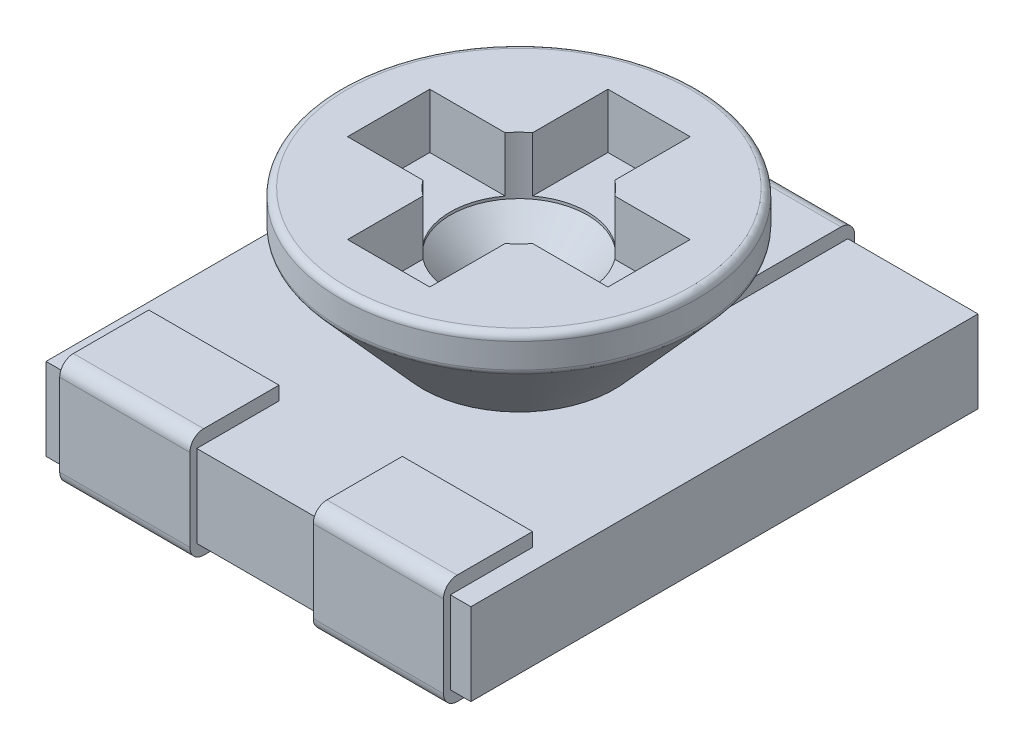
ISO-10303-21;
HEADER;
FILE_DESCRIPTION(('STEP AP214'),'2;1');
FILE_NAME('part.step','',(''),(''),'','','');
FILE_SCHEMA(('AUTOMOTIVE_DESIGN { 1 0 10303 214 1 1 1 1 }'));
ENDSEC;
DATA;
#1=APPLICATION_CONTEXT('core data for automotive mechanical design processes');
#2=APPLICATION_PROTOCOL_DEFINITION('international standard','automotive_design',2000,#1);
#3=PRODUCT_CONTEXT('',#1,'mechanical');
#4=PRODUCT('Part','Part','',(#3));
#5=PRODUCT_RELATED_PRODUCT_CATEGORY('part','',(#4));
#6=PRODUCT_DEFINITION_FORMATION('','',#4);
#7=PRODUCT_DEFINITION_CONTEXT('part definition',#1,'design');
#8=PRODUCT_DEFINITION('design','',#6,#7);
#9=PRODUCT_DEFINITION_SHAPE('','',#8);
#10=(LENGTH_UNIT() NAMED_UNIT(*) SI_UNIT(.MILLI.,.METRE.));
#11=(NAMED_UNIT(*) PLANE_ANGLE_UNIT() SI_UNIT($,.RADIAN.));
#12=(NAMED_UNIT(*) SI_UNIT($,.STERADIAN.) SOLID_ANGLE_UNIT());
#13=UNCERTAINTY_MEASURE_WITH_UNIT(LENGTH_MEASURE(1.E-05),#10,'distance_accuracy_value','');
#14=(GEOMETRIC_REPRESENTATION_CONTEXT(3) GLOBAL_UNCERTAINTY_ASSIGNED_CONTEXT((#13)) GLOBAL_UNIT_ASSIGNED_CONTEXT((#10,
#11,#12)) REPRESENTATION_CONTEXT('',''));
#15=CARTESIAN_POINT('',(0.,0.,0.));
#16=DIRECTION('',(0.,0.,1.));
#17=DIRECTION('',(1.,0.,0.));
#18=AXIS2_PLACEMENT_3D('',#15,#16,#17);
#19=CARTESIAN_POINT('',(-1.55,0.7,-1.8));
#20=DIRECTION('',(0.,-1.,0.));
#21=DIRECTION('',(0.,0.,-1.));
#22=AXIS2_PLACEMENT_3D('',#19,#20,#21);
#23=PLANE('',#22);
#24=CARTESIAN_POINT('',(0.,0.7,0.));
#25=DIRECTION('',(0.,-1.,0.));
#26=DIRECTION('',(0.,0.,-1.));
#27=AXIS2_PLACEMENT_3D('',#24,#25,#26);
#28=CIRCLE('',#27,0.7);
#29=CARTESIAN_POINT('',(0.,0.7,-0.7));
#30=VERTEX_POINT('',#29);
#31=EDGE_CURVE('E515',#30,#30,#28,.T.);
#32=ORIENTED_EDGE('',*,*,#31,.T.);
#33=EDGE_LOOP('',(#32));
#34=FACE_BOUND('',#33,.T.);
#35=DIRECTION('',(0.,0.,1.));
#36=VECTOR('',#35,1.);
#37=CARTESIAN_POINT('',(0.45,0.7,-1.8));
#38=LINE('',#37,#36);
#39=CARTESIAN_POINT('',(0.45,0.7,1.3));
#40=VERTEX_POINT('',#39);
#41=CARTESIAN_POINT('',(0.45,0.7,1.9));
#42=VERTEX_POINT('',#41);
#43=EDGE_CURVE('E573',#40,#42,#38,.T.);
#44=ORIENTED_EDGE('',*,*,#43,.F.);
#45=DIRECTION('',(-1.,0.,0.));
#46=VECTOR('',#45,1.);
#47=CARTESIAN_POINT('',(-1.55,0.7,1.3));
#48=LINE('',#47,#46);
#49=CARTESIAN_POINT('',(1.4,0.7,1.3));
#50=VERTEX_POINT('',#49);
#51=EDGE_CURVE('E577',#50,#40,#48,.T.);
#52=ORIENTED_EDGE('',*,*,#51,.F.);
#53=DIRECTION('',(0.,0.,-1.));
#54=VECTOR('',#53,1.);
#55=CARTESIAN_POINT('',(1.4,0.7,-1.8));
#56=LINE('',#55,#54);
#57=CARTESIAN_POINT('',(1.4,0.7,1.9));
#58=VERTEX_POINT('',#57);
#59=EDGE_CURVE('E566',#58,#50,#56,.T.);
#60=ORIENTED_EDGE('',*,*,#59,.F.);
#61=DIRECTION('',(1.,0.,0.));
#62=VECTOR('',#61,1.);
#63=CARTESIAN_POINT('',(-1.55,0.7,1.9));
#64=LINE('',#63,#62);
#65=CARTESIAN_POINT('',(1.55,0.7,1.9));
#66=VERTEX_POINT('',#65);
#67=EDGE_CURVE('E697',#58,#66,#64,.T.);
#68=ORIENTED_EDGE('',*,*,#67,.T.);
#69=DIRECTION('',(0.,0.,-1.));
#70=VECTOR('',#69,1.);
#71=CARTESIAN_POINT('',(1.55,0.7,1.9));
#72=LINE('',#71,#70);
#73=CARTESIAN_POINT('',(1.55,0.7,-1.8));
#74=VERTEX_POINT('',#73);
#75=EDGE_CURVE('E703',#66,#74,#72,.T.);
#76=ORIENTED_EDGE('',*,*,#75,.T.);
#77=DIRECTION('',(-1.,0.,0.));
#78=VECTOR('',#77,1.);
#79=CARTESIAN_POINT('',(-1.55,0.7,-1.8));
#80=LINE('',#79,#78);
#81=CARTESIAN_POINT('',(0.6,0.7,-1.8));
#82=VERTEX_POINT('',#81);
#83=EDGE_CURVE('E708',#74,#82,#80,.T.);
#84=ORIENTED_EDGE('',*,*,#83,.T.);
#85=DIRECTION('',(0.,0.,-1.));
#86=VECTOR('',#85,1.);
#87=CARTESIAN_POINT('',(0.6,0.7,-1.8));
#88=LINE('',#87,#86);
#89=CARTESIAN_POINT('',(0.6,0.7,-0.9));
#90=VERTEX_POINT('',#89);
#91=EDGE_CURVE('E680',#90,#82,#88,.T.);
#92=ORIENTED_EDGE('',*,*,#91,.F.);
#93=DIRECTION('',(1.,0.,0.));
#94=VECTOR('',#93,1.);
#95=CARTESIAN_POINT('',(-1.55,0.7,-0.9));
#96=LINE('',#95,#94);
#97=CARTESIAN_POINT('',(-0.6,0.7,-0.9));
#98=VERTEX_POINT('',#97);
#99=EDGE_CURVE('E683',#98,#90,#96,.T.);
#100=ORIENTED_EDGE('',*,*,#99,.F.);
#101=DIRECTION('',(0.,0.,1.));
#102=VECTOR('',#101,1.);
#103=CARTESIAN_POINT('',(-0.6,0.7,-1.8));
#104=LINE('',#103,#102);
#105=CARTESIAN_POINT('',(-0.6,0.7,-1.8));
#106=VERTEX_POINT('',#105);
#107=EDGE_CURVE('E689',#106,#98,#104,.T.);
#108=ORIENTED_EDGE('',*,*,#107,.F.);
#109=CARTESIAN_POINT('',(-1.55,0.7,-1.8));
#110=VERTEX_POINT('',#109);
#111=EDGE_CURVE('E707',#106,#110,#80,.T.);
#112=ORIENTED_EDGE('',*,*,#111,.T.);
#113=DIRECTION('',(0.,0.,1.));
#114=VECTOR('',#113,1.);
#115=CARTESIAN_POINT('',(-1.55,0.7,1.9));
#116=LINE('',#115,#114);
#117=CARTESIAN_POINT('',(-1.55,0.7,1.9));
#118=VERTEX_POINT('',#117);
#119=EDGE_CURVE('E693',#110,#118,#116,.T.);
#120=ORIENTED_EDGE('',*,*,#119,.T.);
#121=CARTESIAN_POINT('',(-1.4,0.7,1.9));
#122=VERTEX_POINT('',#121);
#123=EDGE_CURVE('E699',#118,#122,#64,.T.);
#124=ORIENTED_EDGE('',*,*,#123,.T.);
#125=DIRECTION('',(0.,0.,1.));
#126=VECTOR('',#125,1.);
#127=CARTESIAN_POINT('',(-1.4,0.7,-1.8));
#128=LINE('',#127,#126);
#129=CARTESIAN_POINT('',(-1.4,0.7,1.3));
#130=VERTEX_POINT('',#129);
#131=EDGE_CURVE('E630',#130,#122,#128,.T.);
#132=ORIENTED_EDGE('',*,*,#131,.F.);
#133=DIRECTION('',(-1.,0.,0.));
#134=VECTOR('',#133,1.);
#135=CARTESIAN_POINT('',(-1.55,0.7,1.3));
#136=LINE('',#135,#134);
#137=CARTESIAN_POINT('',(-0.45,0.7,1.3));
#138=VERTEX_POINT('',#137);
#139=EDGE_CURVE('E634',#138,#130,#136,.T.);
#140=ORIENTED_EDGE('',*,*,#139,.F.);
#141=DIRECTION('',(0.,0.,-1.));
#142=VECTOR('',#141,1.);
#143=CARTESIAN_POINT('',(-0.45,0.7,-1.8));
#144=LINE('',#143,#142);
#145=CARTESIAN_POINT('',(-0.45,0.7,1.9));
#146=VERTEX_POINT('',#145);
#147=EDGE_CURVE('E623',#146,#138,#144,.T.);
#148=ORIENTED_EDGE('',*,*,#147,.F.);
#149=EDGE_CURVE('E704',#146,#42,#64,.T.);
#150=ORIENTED_EDGE('',*,*,#149,.T.);
#151=EDGE_LOOP('',(#44,#52,#60,#68,#76,#84,#92,#100,#108,#112,#120,#124,#132,#140,#148,#150));
#152=FACE_BOUND('',#151,.T.);
#153=ADVANCED_FACE('F34',(#34,#152),#23,.F.);
#154=CARTESIAN_POINT('',(-1.55,0.1,-1.8));
#155=DIRECTION('',(0.,-1.,0.));
#156=DIRECTION('',(0.,0.,-1.));
#157=AXIS2_PLACEMENT_3D('',#154,#155,#156);
#158=PLANE('',#157);
#159=DIRECTION('',(-1.,0.,0.));
#160=VECTOR('',#159,1.);
#161=CARTESIAN_POINT('',(-1.55,0.1,1.3));
#162=LINE('',#161,#160);
#163=CARTESIAN_POINT('',(1.4,0.1,1.3));
#164=VERTEX_POINT('',#163);
#165=CARTESIAN_POINT('',(0.45,0.1,1.3));
#166=VERTEX_POINT('',#165);
#167=EDGE_CURVE('E775',#164,#166,#162,.T.);
#168=ORIENTED_EDGE('',*,*,#167,.T.);
#169=DIRECTION('',(0.,0.,1.));
#170=VECTOR('',#169,1.);
#171=CARTESIAN_POINT('',(0.45,0.1,-1.8));
#172=LINE('',#171,#170);
#173=CARTESIAN_POINT('',(0.45,0.1,1.9));
#174=VERTEX_POINT('',#173);
#175=EDGE_CURVE('E570',#166,#174,#172,.T.);
#176=ORIENTED_EDGE('',*,*,#175,.T.);
#177=DIRECTION('',(1.,0.,0.));
#178=VECTOR('',#177,1.);
#179=CARTESIAN_POINT('',(-1.55,0.1,1.9));
#180=LINE('',#179,#178);
#181=CARTESIAN_POINT('',(-0.45,0.1,1.9));
#182=VERTEX_POINT('',#181);
#183=EDGE_CURVE('E722',#182,#174,#180,.T.);
#184=ORIENTED_EDGE('',*,*,#183,.F.);
#185=DIRECTION('',(0.,0.,-1.));
#186=VECTOR('',#185,1.);
#187=CARTESIAN_POINT('',(-0.45,0.1,-1.8));
#188=LINE('',#187,#186);
#189=CARTESIAN_POINT('',(-0.45,0.1,1.3));
#190=VERTEX_POINT('',#189);
#191=EDGE_CURVE('E620',#182,#190,#188,.T.);
#192=ORIENTED_EDGE('',*,*,#191,.T.);
#193=DIRECTION('',(-1.,0.,0.));
#194=VECTOR('',#193,1.);
#195=CARTESIAN_POINT('',(-1.55,0.1,1.3));
#196=LINE('',#195,#194);
#197=CARTESIAN_POINT('',(-1.4,0.1,1.3));
#198=VERTEX_POINT('',#197);
#199=EDGE_CURVE('E764',#190,#198,#196,.T.);
#200=ORIENTED_EDGE('',*,*,#199,.T.);
#201=DIRECTION('',(0.,0.,1.));
#202=VECTOR('',#201,1.);
#203=CARTESIAN_POINT('',(-1.4,0.1,-1.8));
#204=LINE('',#203,#202);
#205=CARTESIAN_POINT('',(-1.4,0.1,1.9));
#206=VERTEX_POINT('',#205);
#207=EDGE_CURVE('E627',#198,#206,#204,.T.);
#208=ORIENTED_EDGE('',*,*,#207,.T.);
#209=CARTESIAN_POINT('',(-1.55,0.1,1.9));
#210=VERTEX_POINT('',#209);
#211=EDGE_CURVE('E717',#210,#206,#180,.T.);
#212=ORIENTED_EDGE('',*,*,#211,.F.);
#213=DIRECTION('',(0.,0.,1.));
#214=VECTOR('',#213,1.);
#215=CARTESIAN_POINT('',(-1.55,0.1,1.9));
#216=LINE('',#215,#214);
#217=CARTESIAN_POINT('',(-1.55,0.1,-1.8));
#218=VERTEX_POINT('',#217);
#219=EDGE_CURVE('E692',#218,#210,#216,.T.);
#220=ORIENTED_EDGE('',*,*,#219,.F.);
#221=DIRECTION('',(-1.,0.,0.));
#222=VECTOR('',#221,1.);
#223=CARTESIAN_POINT('',(-1.55,0.1,-1.8));
#224=LINE('',#223,#222);
#225=CARTESIAN_POINT('',(-0.6,0.1,-1.8));
#226=VERTEX_POINT('',#225);
#227=EDGE_CURVE('E725',#226,#218,#224,.T.);
#228=ORIENTED_EDGE('',*,*,#227,.F.);
#229=DIRECTION('',(0.,0.,1.));
#230=VECTOR('',#229,1.);
#231=CARTESIAN_POINT('',(-0.6,0.1,-1.8));
#232=LINE('',#231,#230);
#233=CARTESIAN_POINT('',(-0.6,0.1,-0.9));
#234=VERTEX_POINT('',#233);
#235=EDGE_CURVE('E752',#226,#234,#232,.T.);
#236=ORIENTED_EDGE('',*,*,#235,.T.);
#237=DIRECTION('',(1.,0.,0.));
#238=VECTOR('',#237,1.);
#239=CARTESIAN_POINT('',(-1.55,0.1,-0.9));
#240=LINE('',#239,#238);
#241=CARTESIAN_POINT('',(0.6,0.1,-0.9));
#242=VERTEX_POINT('',#241);
#243=EDGE_CURVE('E748',#234,#242,#240,.T.);
#244=ORIENTED_EDGE('',*,*,#243,.T.);
#245=DIRECTION('',(0.,0.,-1.));
#246=VECTOR('',#245,1.);
#247=CARTESIAN_POINT('',(0.6,0.1,-1.8));
#248=LINE('',#247,#246);
#249=CARTESIAN_POINT('',(0.599999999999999,0.1,-1.8));
#250=VERTEX_POINT('',#249);
#251=EDGE_CURVE('E744',#242,#250,#248,.T.);
#252=ORIENTED_EDGE('',*,*,#251,.T.);
#253=CARTESIAN_POINT('',(1.55,0.1,-1.8));
#254=VERTEX_POINT('',#253);
#255=EDGE_CURVE('E698',#254,#250,#224,.T.);
#256=ORIENTED_EDGE('',*,*,#255,.F.);
#257=DIRECTION('',(0.,0.,-1.));
#258=VECTOR('',#257,1.);
#259=CARTESIAN_POINT('',(1.55,0.1,1.9));
#260=LINE('',#259,#258);
#261=CARTESIAN_POINT('',(1.55,0.1,1.9));
#262=VERTEX_POINT('',#261);
#263=EDGE_CURVE('E721',#262,#254,#260,.T.);
#264=ORIENTED_EDGE('',*,*,#263,.F.);
#265=CARTESIAN_POINT('',(1.4,0.1,1.9));
#266=VERTEX_POINT('',#265);
#267=EDGE_CURVE('E716',#266,#262,#180,.T.);
#268=ORIENTED_EDGE('',*,*,#267,.F.);
#269=DIRECTION('',(0.,0.,-1.));
#270=VECTOR('',#269,1.);
#271=CARTESIAN_POINT('',(1.4,0.1,-1.8));
#272=LINE('',#271,#270);
#273=EDGE_CURVE('E563',#266,#164,#272,.T.);
#274=ORIENTED_EDGE('',*,*,#273,.T.);
#275=EDGE_LOOP('',(#168,#176,#184,#192,#200,#208,#212,#220,#228,#236,#244,#252,#256,#264,#268,#274));
#276=FACE_BOUND('',#275,.T.);
#277=ADVANCED_FACE('F936',(#276),#158,.T.);
#278=CARTESIAN_POINT('',(-1.55,0.7,1.9));
#279=DIRECTION('',(0.,0.,-1.));
#280=DIRECTION('',(-1.,0.,0.));
#281=AXIS2_PLACEMENT_3D('',#278,#279,#280);
#282=PLANE('',#281);
#283=DIRECTION('',(0.,-1.,0.));
#284=VECTOR('',#283,1.);
#285=CARTESIAN_POINT('',(0.45,0.7,1.9));
#286=LINE('',#285,#284);
#287=EDGE_CURVE('E771',#42,#174,#286,.T.);
#288=ORIENTED_EDGE('',*,*,#287,.F.);
#289=ORIENTED_EDGE('',*,*,#149,.F.);
#290=DIRECTION('',(0.,1.,0.));
#291=VECTOR('',#290,1.);
#292=CARTESIAN_POINT('',(-0.45,0.7,1.9));
#293=LINE('',#292,#291);
#294=EDGE_CURVE('E756',#182,#146,#293,.T.);
#295=ORIENTED_EDGE('',*,*,#294,.F.);
#296=ORIENTED_EDGE('',*,*,#183,.T.);
#297=EDGE_LOOP('',(#288,#289,#295,#296));
#298=FACE_BOUND('',#297,.T.);
#299=ADVANCED_FACE('F943',(#298),#282,.F.);
#300=DIRECTION('',(0.,1.,0.));
#301=VECTOR('',#300,1.);
#302=CARTESIAN_POINT('',(1.4,0.7,1.9));
#303=LINE('',#302,#301);
#304=EDGE_CURVE('E767',#266,#58,#303,.T.);
#305=ORIENTED_EDGE('',*,*,#304,.F.);
#306=ORIENTED_EDGE('',*,*,#267,.T.);
#307=DIRECTION('',(0.,-1.,0.));
#308=VECTOR('',#307,1.);
#309=CARTESIAN_POINT('',(1.55,0.7,1.9));
#310=LINE('',#309,#308);
#311=EDGE_CURVE('E736',#66,#262,#310,.T.);
#312=ORIENTED_EDGE('',*,*,#311,.F.);
#313=ORIENTED_EDGE('',*,*,#67,.F.);
#314=EDGE_LOOP('',(#305,#306,#312,#313));
#315=FACE_BOUND('',#314,.T.);
#316=ADVANCED_FACE('F1148',(#315),#282,.F.);
#317=DIRECTION('',(0.,-1.,0.));
#318=VECTOR('',#317,1.);
#319=CARTESIAN_POINT('',(-1.4,0.7,1.9));
#320=LINE('',#319,#318);
#321=EDGE_CURVE('E760',#122,#206,#320,.T.);
#322=ORIENTED_EDGE('',*,*,#321,.F.);
#323=ORIENTED_EDGE('',*,*,#123,.F.);
#324=DIRECTION('',(0.,-1.,0.));
#325=VECTOR('',#324,1.);
#326=CARTESIAN_POINT('',(-1.55,0.7,1.9));
#327=LINE('',#326,#325);
#328=EDGE_CURVE('E740',#118,#210,#327,.T.);
#329=ORIENTED_EDGE('',*,*,#328,.T.);
#330=ORIENTED_EDGE('',*,*,#211,.T.);
#331=EDGE_LOOP('',(#322,#323,#329,#330));
#332=FACE_BOUND('',#331,.T.);
#333=ADVANCED_FACE('F1168',(#332),#282,.F.);
#334=CARTESIAN_POINT('',(-1.55,0.7,-1.8));
#335=DIRECTION('',(0.,0.,1.));
#336=DIRECTION('',(1.,0.,0.));
#337=AXIS2_PLACEMENT_3D('',#334,#335,#336);
#338=PLANE('',#337);
#339=DIRECTION('',(0.,1.,0.));
#340=VECTOR('',#339,1.);
#341=CARTESIAN_POINT('',(-0.6,0.7,-1.8));
#342=LINE('',#341,#340);
#343=EDGE_CURVE('E686',#226,#106,#342,.T.);
#344=ORIENTED_EDGE('',*,*,#343,.F.);
#345=ORIENTED_EDGE('',*,*,#227,.T.);
#346=DIRECTION('',(0.,-1.,0.));
#347=VECTOR('',#346,1.);
#348=CARTESIAN_POINT('',(-1.55,0.7,-1.8));
#349=LINE('',#348,#347);
#350=EDGE_CURVE('E712',#110,#218,#349,.T.);
#351=ORIENTED_EDGE('',*,*,#350,.F.);
#352=ORIENTED_EDGE('',*,*,#111,.F.);
#353=EDGE_LOOP('',(#344,#345,#351,#352));
#354=FACE_BOUND('',#353,.T.);
#355=ADVANCED_FACE('F1164',(#354),#338,.F.);
#356=DIRECTION('',(0.,-1.,0.));
#357=VECTOR('',#356,1.);
#358=CARTESIAN_POINT('',(0.6,0.7,-1.8));
#359=LINE('',#358,#357);
#360=EDGE_CURVE('E677',#82,#250,#359,.T.);
#361=ORIENTED_EDGE('',*,*,#360,.F.);
#362=ORIENTED_EDGE('',*,*,#83,.F.);
#363=DIRECTION('',(0.,-1.,0.));
#364=VECTOR('',#363,1.);
#365=CARTESIAN_POINT('',(1.55,0.7,-1.8));
#366=LINE('',#365,#364);
#367=EDGE_CURVE('E732',#74,#254,#366,.T.);
#368=ORIENTED_EDGE('',*,*,#367,.T.);
#369=ORIENTED_EDGE('',*,*,#255,.T.);
#370=EDGE_LOOP('',(#361,#362,#368,#369));
#371=FACE_BOUND('',#370,.T.);
#372=ADVANCED_FACE('F1093',(#371),#338,.F.);
#373=CARTESIAN_POINT('',(-1.55,0.7,1.9));
#374=DIRECTION('',(1.,0.,0.));
#375=DIRECTION('',(0.,0.,-1.));
#376=AXIS2_PLACEMENT_3D('',#373,#374,#375);
#377=PLANE('',#376);
#378=ORIENTED_EDGE('',*,*,#219,.T.);
#379=ORIENTED_EDGE('',*,*,#328,.F.);
#380=ORIENTED_EDGE('',*,*,#119,.F.);
#381=ORIENTED_EDGE('',*,*,#350,.T.);
#382=EDGE_LOOP('',(#378,#379,#380,#381));
#383=FACE_BOUND('',#382,.T.);
#384=ADVANCED_FACE('F1068',(#383),#377,.F.);
#385=CARTESIAN_POINT('',(1.55,0.7,1.9));
#386=DIRECTION('',(-1.,0.,0.));
#387=DIRECTION('',(0.,0.,1.));
#388=AXIS2_PLACEMENT_3D('',#385,#386,#387);
#389=PLANE('',#388);
#390=ORIENTED_EDGE('',*,*,#263,.T.);
#391=ORIENTED_EDGE('',*,*,#367,.F.);
#392=ORIENTED_EDGE('',*,*,#75,.F.);
#393=ORIENTED_EDGE('',*,*,#311,.T.);
#394=EDGE_LOOP('',(#390,#391,#392,#393));
#395=FACE_BOUND('',#394,.T.);
#396=ADVANCED_FACE('F1061',(#395),#389,.F.);
#397=CARTESIAN_POINT('',(-0.6,0.8,-1.85));
#398=DIRECTION('',(1.,0.,0.));
#399=DIRECTION('',(0.,0.,-1.));
#400=AXIS2_PLACEMENT_3D('',#397,#398,#399);
#401=PLANE('',#400);
#402=DIRECTION('',(0.,-1.,0.));
#403=VECTOR('',#402,1.);
#404=CARTESIAN_POINT('',(-0.6,0.8,-1.85));
#405=LINE('',#404,#403);
#406=CARTESIAN_POINT('',(-0.6,0.7,-1.85));
#407=VERTEX_POINT('',#406);
#408=CARTESIAN_POINT('',(-0.6,0.1,-1.85));
#409=VERTEX_POINT('',#408);
#410=EDGE_CURVE('E650',#407,#409,#405,.T.);
#411=ORIENTED_EDGE('',*,*,#410,.T.);
#412=CARTESIAN_POINT('',(-0.6,0.1,-1.75));
#413=DIRECTION('',(1.,0.,0.));
#414=DIRECTION('',(0.,0.,-1.));
#415=AXIS2_PLACEMENT_3D('',#412,#413,#414);
#416=CIRCLE('',#415,0.1);
#417=CARTESIAN_POINT('',(-0.6,0.,-1.75));
#418=VERTEX_POINT('',#417);
#419=EDGE_CURVE('E788',#409,#418,#416,.F.);
#420=ORIENTED_EDGE('',*,*,#419,.T.);
#421=DIRECTION('',(0.,0.,1.));
#422=VECTOR('',#421,1.);
#423=CARTESIAN_POINT('',(-0.6,0.,-1.85));
#424=LINE('',#423,#422);
#425=CARTESIAN_POINT('',(-0.6,0.,-0.9));
#426=VERTEX_POINT('',#425);
#427=EDGE_CURVE('E638',#418,#426,#424,.T.);
#428=ORIENTED_EDGE('',*,*,#427,.T.);
#429=DIRECTION('',(0.,-1.,0.));
#430=VECTOR('',#429,1.);
#431=CARTESIAN_POINT('',(-0.6,0.8,-0.9));
#432=LINE('',#431,#430);
#433=EDGE_CURVE('E672',#234,#426,#432,.T.);
#434=ORIENTED_EDGE('',*,*,#433,.F.);
#435=ORIENTED_EDGE('',*,*,#235,.F.);
#436=ORIENTED_EDGE('',*,*,#343,.T.);
#437=ORIENTED_EDGE('',*,*,#107,.T.);
#438=CARTESIAN_POINT('',(-0.6,0.8,-0.9));
#439=VERTEX_POINT('',#438);
#440=EDGE_CURVE('E673',#439,#98,#432,.T.);
#441=ORIENTED_EDGE('',*,*,#440,.F.);
#442=DIRECTION('',(0.,0.,1.));
#443=VECTOR('',#442,1.);
#444=CARTESIAN_POINT('',(-0.6,0.8,-1.85));
#445=LINE('',#444,#443);
#446=CARTESIAN_POINT('',(-0.6,0.8,-1.75));
#447=VERTEX_POINT('',#446);
#448=EDGE_CURVE('E639',#447,#439,#445,.T.);
#449=ORIENTED_EDGE('',*,*,#448,.F.);
#450=CARTESIAN_POINT('',(-0.6,0.7,-1.75));
#451=DIRECTION('',(1.,0.,0.));
#452=DIRECTION('',(0.,0.,-1.));
#453=AXIS2_PLACEMENT_3D('',#450,#451,#452);
#454=CIRCLE('',#453,0.1);
#455=EDGE_CURVE('E785',#447,#407,#454,.F.);
#456=ORIENTED_EDGE('',*,*,#455,.T.);
#457=EDGE_LOOP('',(#411,#420,#428,#434,#435,#436,#437,#441,#449,#456));
#458=FACE_BOUND('',#457,.T.);
#459=ADVANCED_FACE('F1059',(#458),#401,.F.);
#460=CARTESIAN_POINT('',(-0.6,0.8,-0.9));
#461=DIRECTION('',(0.,0.,-1.));
#462=DIRECTION('',(-1.,0.,0.));
#463=AXIS2_PLACEMENT_3D('',#460,#461,#462);
#464=PLANE('',#463);
#465=ORIENTED_EDGE('',*,*,#440,.T.);
#466=ORIENTED_EDGE('',*,*,#99,.T.);
#467=DIRECTION('',(0.,-1.,0.));
#468=VECTOR('',#467,1.);
#469=CARTESIAN_POINT('',(0.6,0.8,-0.9));
#470=LINE('',#469,#468);
#471=CARTESIAN_POINT('',(0.6,0.8,-0.9));
#472=VERTEX_POINT('',#471);
#473=EDGE_CURVE('E668',#472,#90,#470,.T.);
#474=ORIENTED_EDGE('',*,*,#473,.F.);
#475=DIRECTION('',(1.,0.,0.));
#476=VECTOR('',#475,1.);
#477=CARTESIAN_POINT('',(-0.6,0.8,-0.9));
#478=LINE('',#477,#476);
#479=EDGE_CURVE('E642',#439,#472,#478,.T.);
#480=ORIENTED_EDGE('',*,*,#479,.F.);
#481=EDGE_LOOP('',(#465,#466,#474,#480));
#482=FACE_BOUND('',#481,.T.);
#483=ADVANCED_FACE('F1055',(#482),#464,.F.);
#484=CARTESIAN_POINT('',(0.6,0.8,-1.85));
#485=DIRECTION('',(-1.,0.,0.));
#486=DIRECTION('',(0.,0.,1.));
#487=AXIS2_PLACEMENT_3D('',#484,#485,#486);
#488=PLANE('',#487);
#489=DIRECTION('',(0.,0.,-1.));
#490=VECTOR('',#489,1.);
#491=CARTESIAN_POINT('',(0.6,0.,-1.85));
#492=LINE('',#491,#490);
#493=CARTESIAN_POINT('',(0.6,0.,-0.9));
#494=VERTEX_POINT('',#493);
#495=CARTESIAN_POINT('',(0.6,0.,-1.75));
#496=VERTEX_POINT('',#495);
#497=EDGE_CURVE('E643',#494,#496,#492,.T.);
#498=ORIENTED_EDGE('',*,*,#497,.T.);
#499=CARTESIAN_POINT('',(0.6,0.1,-1.75));
#500=DIRECTION('',(-1.,0.,0.));
#501=DIRECTION('',(0.,0.,1.));
#502=AXIS2_PLACEMENT_3D('',#499,#500,#501);
#503=CIRCLE('',#502,0.1);
#504=CARTESIAN_POINT('',(0.6,0.1,-1.85));
#505=VERTEX_POINT('',#504);
#506=EDGE_CURVE('E797',#496,#505,#503,.F.);
#507=ORIENTED_EDGE('',*,*,#506,.T.);
#508=DIRECTION('',(0.,-1.,0.));
#509=VECTOR('',#508,1.);
#510=CARTESIAN_POINT('',(0.6,0.8,-1.85));
#511=LINE('',#510,#509);
#512=CARTESIAN_POINT('',(0.6,0.7,-1.85));
#513=VERTEX_POINT('',#512);
#514=EDGE_CURVE('E663',#513,#505,#511,.T.);
#515=ORIENTED_EDGE('',*,*,#514,.F.);
#516=CARTESIAN_POINT('',(0.6,0.7,-1.75));
#517=DIRECTION('',(-1.,0.,0.));
#518=DIRECTION('',(0.,0.,1.));
#519=AXIS2_PLACEMENT_3D('',#516,#517,#518);
#520=CIRCLE('',#519,0.1);
#521=CARTESIAN_POINT('',(0.6,0.8,-1.75));
#522=VERTEX_POINT('',#521);
#523=EDGE_CURVE('E794',#513,#522,#520,.F.);
#524=ORIENTED_EDGE('',*,*,#523,.T.);
#525=DIRECTION('',(0.,0.,-1.));
#526=VECTOR('',#525,1.);
#527=CARTESIAN_POINT('',(0.6,0.8,-1.85));
#528=LINE('',#527,#526);
#529=EDGE_CURVE('E646',#472,#522,#528,.T.);
#530=ORIENTED_EDGE('',*,*,#529,.F.);
#531=ORIENTED_EDGE('',*,*,#473,.T.);
#532=ORIENTED_EDGE('',*,*,#91,.T.);
#533=ORIENTED_EDGE('',*,*,#360,.T.);
#534=ORIENTED_EDGE('',*,*,#251,.F.);
#535=EDGE_CURVE('E667',#242,#494,#470,.T.);
#536=ORIENTED_EDGE('',*,*,#535,.T.);
#537=EDGE_LOOP('',(#498,#507,#515,#524,#530,#531,#532,#533,#534,#536));
#538=FACE_BOUND('',#537,.T.);
#539=ADVANCED_FACE('F1052',(#538),#488,.F.);
#540=ORIENTED_EDGE('',*,*,#243,.F.);
#541=ORIENTED_EDGE('',*,*,#433,.T.);
#542=DIRECTION('',(1.,0.,0.));
#543=VECTOR('',#542,1.);
#544=CARTESIAN_POINT('',(-0.6,0.,-0.9));
#545=LINE('',#544,#543);
#546=EDGE_CURVE('E653',#426,#494,#545,.T.);
#547=ORIENTED_EDGE('',*,*,#546,.T.);
#548=ORIENTED_EDGE('',*,*,#535,.F.);
#549=EDGE_LOOP('',(#540,#541,#547,#548));
#550=FACE_BOUND('',#549,.T.);
#551=ADVANCED_FACE('F1050',(#550),#464,.F.);
#552=CARTESIAN_POINT('',(-0.6,0.8,-1.85));
#553=DIRECTION('',(0.,0.,1.));
#554=DIRECTION('',(1.,0.,0.));
#555=AXIS2_PLACEMENT_3D('',#552,#553,#554);
#556=PLANE('',#555);
#557=ORIENTED_EDGE('',*,*,#514,.T.);
#558=DIRECTION('',(-1.,0.,0.));
#559=VECTOR('',#558,1.);
#560=CARTESIAN_POINT('',(-0.6,0.1,-1.85));
#561=LINE('',#560,#559);
#562=EDGE_CURVE('E781',#505,#409,#561,.T.);
#563=ORIENTED_EDGE('',*,*,#562,.T.);
#564=ORIENTED_EDGE('',*,*,#410,.F.);
#565=DIRECTION('',(-1.,0.,0.));
#566=VECTOR('',#565,1.);
#567=CARTESIAN_POINT('',(0.6,0.7,-1.85));
#568=LINE('',#567,#566);
#569=EDGE_CURVE('E778',#407,#513,#568,.F.);
#570=ORIENTED_EDGE('',*,*,#569,.T.);
#571=EDGE_LOOP('',(#557,#563,#564,#570));
#572=FACE_BOUND('',#571,.T.);
#573=ADVANCED_FACE('F1043',(#572),#556,.F.);
#574=CARTESIAN_POINT('',(-0.6,0.8,-0.9));
#575=DIRECTION('',(0.,1.,0.));
#576=DIRECTION('',(0.,0.,1.));
#577=AXIS2_PLACEMENT_3D('',#574,#575,#576);
#578=PLANE('',#577);
#579=ORIENTED_EDGE('',*,*,#529,.T.);
#580=DIRECTION('',(-1.,0.,0.));
#581=VECTOR('',#580,1.);
#582=CARTESIAN_POINT('',(-0.6,0.8,-1.75));
#583=LINE('',#582,#581);
#584=EDGE_CURVE('E800',#522,#447,#583,.T.);
#585=ORIENTED_EDGE('',*,*,#584,.T.);
#586=ORIENTED_EDGE('',*,*,#448,.T.);
#587=ORIENTED_EDGE('',*,*,#479,.T.);
#588=EDGE_LOOP('',(#579,#585,#586,#587));
#589=FACE_BOUND('',#588,.T.);
#590=ADVANCED_FACE('F1039',(#589),#578,.T.);
#591=CARTESIAN_POINT('',(-0.6,0.,-0.9));
#592=DIRECTION('',(0.,1.,0.));
#593=DIRECTION('',(0.,0.,1.));
#594=AXIS2_PLACEMENT_3D('',#591,#592,#593);
#595=PLANE('',#594);
#596=ORIENTED_EDGE('',*,*,#427,.F.);
#597=DIRECTION('',(-1.,0.,0.));
#598=VECTOR('',#597,1.);
#599=CARTESIAN_POINT('',(-0.6,0.,-1.75));
#600=LINE('',#599,#598);
#601=EDGE_CURVE('E791',#418,#496,#600,.F.);
#602=ORIENTED_EDGE('',*,*,#601,.T.);
#603=ORIENTED_EDGE('',*,*,#497,.F.);
#604=ORIENTED_EDGE('',*,*,#546,.F.);
#605=EDGE_LOOP('',(#596,#602,#603,#604));
#606=FACE_BOUND('',#605,.T.);
#607=ADVANCED_FACE('F1042',(#606),#595,.F.);
#608=CARTESIAN_POINT('',(-1.4,0.8,1.3));
#609=DIRECTION('',(0.,0.,1.));
#610=DIRECTION('',(1.,0.,0.));
#611=AXIS2_PLACEMENT_3D('',#608,#609,#610);
#612=PLANE('',#611);
#613=DIRECTION('',(0.,-1.,0.));
#614=VECTOR('',#613,1.);
#615=CARTESIAN_POINT('',(-0.45,0.8,1.3));
#616=LINE('',#615,#614);
#617=CARTESIAN_POINT('',(-0.45,0.8,1.3));
#618=VERTEX_POINT('',#617);
#619=EDGE_CURVE('E608',#618,#138,#616,.T.);
#620=ORIENTED_EDGE('',*,*,#619,.T.);
#621=ORIENTED_EDGE('',*,*,#139,.T.);
#622=DIRECTION('',(0.,-1.,0.));
#623=VECTOR('',#622,1.);
#624=CARTESIAN_POINT('',(-1.4,0.8,1.3));
#625=LINE('',#624,#623);
#626=CARTESIAN_POINT('',(-1.4,0.8,1.3));
#627=VERTEX_POINT('',#626);
#628=EDGE_CURVE('E603',#627,#130,#625,.T.);
#629=ORIENTED_EDGE('',*,*,#628,.F.);
#630=DIRECTION('',(-1.,0.,0.));
#631=VECTOR('',#630,1.);
#632=CARTESIAN_POINT('',(-1.4,0.8,1.3));
#633=LINE('',#632,#631);
#634=EDGE_CURVE('E590',#618,#627,#633,.T.);
#635=ORIENTED_EDGE('',*,*,#634,.F.);
#636=EDGE_LOOP('',(#620,#621,#629,#635));
#637=FACE_BOUND('',#636,.T.);
#638=ADVANCED_FACE('F1027',(#637),#612,.F.);
#639=CARTESIAN_POINT('',(-1.4,0.8,1.3));
#640=DIRECTION('',(1.,0.,0.));
#641=DIRECTION('',(0.,0.,-1.));
#642=AXIS2_PLACEMENT_3D('',#639,#640,#641);
#643=PLANE('',#642);
#644=DIRECTION('',(0.,0.,1.));
#645=VECTOR('',#644,1.);
#646=CARTESIAN_POINT('',(-1.4,0.,1.3));
#647=LINE('',#646,#645);
#648=CARTESIAN_POINT('',(-1.4,0.,1.3));
#649=VERTEX_POINT('',#648);
#650=CARTESIAN_POINT('',(-1.4,0.,1.85));
#651=VERTEX_POINT('',#650);
#652=EDGE_CURVE('E581',#649,#651,#647,.T.);
#653=ORIENTED_EDGE('',*,*,#652,.T.);
#654=CARTESIAN_POINT('',(-1.4,0.1,1.85));
#655=DIRECTION('',(1.,0.,0.));
#656=DIRECTION('',(0.,0.,-1.));
#657=AXIS2_PLACEMENT_3D('',#654,#655,#656);
#658=CIRCLE('',#657,0.1);
#659=CARTESIAN_POINT('',(-1.4,0.1,1.95));
#660=VERTEX_POINT('',#659);
#661=EDGE_CURVE('E845',#651,#660,#658,.F.);
#662=ORIENTED_EDGE('',*,*,#661,.T.);
#663=DIRECTION('',(0.,-1.,0.));
#664=VECTOR('',#663,1.);
#665=CARTESIAN_POINT('',(-1.4,0.8,1.95));
#666=LINE('',#665,#664);
#667=CARTESIAN_POINT('',(-1.4,0.7,1.95));
#668=VERTEX_POINT('',#667);
#669=EDGE_CURVE('E616',#668,#660,#666,.T.);
#670=ORIENTED_EDGE('',*,*,#669,.F.);
#671=CARTESIAN_POINT('',(-1.4,0.7,1.85));
#672=DIRECTION('',(1.,0.,0.));
#673=DIRECTION('',(0.,0.,-1.));
#674=AXIS2_PLACEMENT_3D('',#671,#672,#673);
#675=CIRCLE('',#674,0.1);
#676=CARTESIAN_POINT('',(-1.4,0.8,1.85));
#677=VERTEX_POINT('',#676);
#678=EDGE_CURVE('E842',#668,#677,#675,.F.);
#679=ORIENTED_EDGE('',*,*,#678,.T.);
#680=DIRECTION('',(0.,0.,1.));
#681=VECTOR('',#680,1.);
#682=CARTESIAN_POINT('',(-1.4,0.8,1.3));
#683=LINE('',#682,#681);
#684=EDGE_CURVE('E582',#627,#677,#683,.T.);
#685=ORIENTED_EDGE('',*,*,#684,.F.);
#686=ORIENTED_EDGE('',*,*,#628,.T.);
#687=ORIENTED_EDGE('',*,*,#131,.T.);
#688=ORIENTED_EDGE('',*,*,#321,.T.);
#689=ORIENTED_EDGE('',*,*,#207,.F.);
#690=EDGE_CURVE('E593',#198,#649,#625,.T.);
#691=ORIENTED_EDGE('',*,*,#690,.T.);
#692=EDGE_LOOP('',(#653,#662,#670,#679,#685,#686,#687,#688,#689,#691));
#693=FACE_BOUND('',#692,.T.);
#694=ADVANCED_FACE('F1031',(#693),#643,.F.);
#695=CARTESIAN_POINT('',(-0.45,0.8,1.3));
#696=DIRECTION('',(-1.,0.,0.));
#697=DIRECTION('',(0.,0.,1.));
#698=AXIS2_PLACEMENT_3D('',#695,#696,#697);
#699=PLANE('',#698);
#700=DIRECTION('',(0.,-1.,0.));
#701=VECTOR('',#700,1.);
#702=CARTESIAN_POINT('',(-0.45,0.8,1.95));
#703=LINE('',#702,#701);
#704=CARTESIAN_POINT('',(-0.45,0.7,1.95));
#705=VERTEX_POINT('',#704);
#706=CARTESIAN_POINT('',(-0.45,0.1,1.95));
#707=VERTEX_POINT('',#706);
#708=EDGE_CURVE('E612',#705,#707,#703,.T.);
#709=ORIENTED_EDGE('',*,*,#708,.T.);
#710=CARTESIAN_POINT('',(-0.45,0.1,1.85));
#711=DIRECTION('',(-1.,0.,0.));
#712=DIRECTION('',(0.,0.,1.));
#713=AXIS2_PLACEMENT_3D('',#710,#711,#712);
#714=CIRCLE('',#713,0.1);
#715=CARTESIAN_POINT('',(-0.45,0.,1.85));
#716=VERTEX_POINT('',#715);
#717=EDGE_CURVE('E836',#707,#716,#714,.F.);
#718=ORIENTED_EDGE('',*,*,#717,.T.);
#719=DIRECTION('',(0.,0.,-1.));
#720=VECTOR('',#719,1.);
#721=CARTESIAN_POINT('',(-0.45,0.,1.3));
#722=LINE('',#721,#720);
#723=CARTESIAN_POINT('',(-0.45,0.,1.3));
#724=VERTEX_POINT('',#723);
#725=EDGE_CURVE('E597',#716,#724,#722,.T.);
#726=ORIENTED_EDGE('',*,*,#725,.T.);
#727=EDGE_CURVE('E607',#190,#724,#616,.T.);
#728=ORIENTED_EDGE('',*,*,#727,.F.);
#729=ORIENTED_EDGE('',*,*,#191,.F.);
#730=ORIENTED_EDGE('',*,*,#294,.T.);
#731=ORIENTED_EDGE('',*,*,#147,.T.);
#732=ORIENTED_EDGE('',*,*,#619,.F.);
#733=DIRECTION('',(0.,0.,-1.));
#734=VECTOR('',#733,1.);
#735=CARTESIAN_POINT('',(-0.45,0.8,1.3));
#736=LINE('',#735,#734);
#737=CARTESIAN_POINT('',(-0.45,0.8,1.85));
#738=VERTEX_POINT('',#737);
#739=EDGE_CURVE('E586',#738,#618,#736,.T.);
#740=ORIENTED_EDGE('',*,*,#739,.F.);
#741=CARTESIAN_POINT('',(-0.45,0.7,1.85));
#742=DIRECTION('',(-1.,0.,0.));
#743=DIRECTION('',(0.,0.,1.));
#744=AXIS2_PLACEMENT_3D('',#741,#742,#743);
#745=CIRCLE('',#744,0.1);
#746=EDGE_CURVE('E833',#738,#705,#745,.F.);
#747=ORIENTED_EDGE('',*,*,#746,.T.);
#748=EDGE_LOOP('',(#709,#718,#726,#728,#729,#730,#731,#732,#740,#747));
#749=FACE_BOUND('',#748,.T.);
#750=ADVANCED_FACE('F1028',(#749),#699,.F.);
#751=CARTESIAN_POINT('',(-1.4,0.8,1.95));
#752=DIRECTION('',(0.,0.,-1.));
#753=DIRECTION('',(-1.,0.,0.));
#754=AXIS2_PLACEMENT_3D('',#751,#752,#753);
#755=PLANE('',#754);
#756=ORIENTED_EDGE('',*,*,#669,.T.);
#757=DIRECTION('',(1.,0.,0.));
#758=VECTOR('',#757,1.);
#759=CARTESIAN_POINT('',(-1.4,0.1,1.95));
#760=LINE('',#759,#758);
#761=EDGE_CURVE('E829',#660,#707,#760,.T.);
#762=ORIENTED_EDGE('',*,*,#761,.T.);
#763=ORIENTED_EDGE('',*,*,#708,.F.);
#764=DIRECTION('',(1.,0.,0.));
#765=VECTOR('',#764,1.);
#766=CARTESIAN_POINT('',(-1.4,0.7,1.95));
#767=LINE('',#766,#765);
#768=EDGE_CURVE('E826',#705,#668,#767,.F.);
#769=ORIENTED_EDGE('',*,*,#768,.T.);
#770=EDGE_LOOP('',(#756,#762,#763,#769));
#771=FACE_BOUND('',#770,.T.);
#772=ADVANCED_FACE('F1025',(#771),#755,.F.);
#773=ORIENTED_EDGE('',*,*,#199,.F.);
#774=ORIENTED_EDGE('',*,*,#727,.T.);
#775=DIRECTION('',(-1.,0.,0.));
#776=VECTOR('',#775,1.);
#777=CARTESIAN_POINT('',(-1.4,0.,1.3));
#778=LINE('',#777,#776);
#779=EDGE_CURVE('E587',#724,#649,#778,.T.);
#780=ORIENTED_EDGE('',*,*,#779,.T.);
#781=ORIENTED_EDGE('',*,*,#690,.F.);
#782=EDGE_LOOP('',(#773,#774,#780,#781));
#783=FACE_BOUND('',#782,.T.);
#784=ADVANCED_FACE('F1018',(#783),#612,.F.);
#785=CARTESIAN_POINT('',(-1.4,0.8,1.95));
#786=DIRECTION('',(0.,1.,0.));
#787=DIRECTION('',(0.,0.,1.));
#788=AXIS2_PLACEMENT_3D('',#785,#786,#787);
#789=PLANE('',#788);
#790=ORIENTED_EDGE('',*,*,#684,.T.);
#791=DIRECTION('',(1.,0.,0.));
#792=VECTOR('',#791,1.);
#793=CARTESIAN_POINT('',(-0.45,0.8,1.85));
#794=LINE('',#793,#792);
#795=EDGE_CURVE('E852',#677,#738,#794,.T.);
#796=ORIENTED_EDGE('',*,*,#795,.T.);
#797=ORIENTED_EDGE('',*,*,#739,.T.);
#798=ORIENTED_EDGE('',*,*,#634,.T.);
#799=EDGE_LOOP('',(#790,#796,#797,#798));
#800=FACE_BOUND('',#799,.T.);
#801=ADVANCED_FACE('F1014',(#800),#789,.T.);
#802=CARTESIAN_POINT('',(-1.4,0.,1.95));
#803=DIRECTION('',(0.,1.,0.));
#804=DIRECTION('',(0.,0.,1.));
#805=AXIS2_PLACEMENT_3D('',#802,#803,#804);
#806=PLANE('',#805);
#807=ORIENTED_EDGE('',*,*,#725,.F.);
#808=DIRECTION('',(1.,0.,0.));
#809=VECTOR('',#808,1.);
#810=CARTESIAN_POINT('',(-1.4,0.,1.85));
#811=LINE('',#810,#809);
#812=EDGE_CURVE('E839',#716,#651,#811,.F.);
#813=ORIENTED_EDGE('',*,*,#812,.T.);
#814=ORIENTED_EDGE('',*,*,#652,.F.);
#815=ORIENTED_EDGE('',*,*,#779,.F.);
#816=EDGE_LOOP('',(#807,#813,#814,#815));
#817=FACE_BOUND('',#816,.T.);
#818=ADVANCED_FACE('F1017',(#817),#806,.F.);
#819=CARTESIAN_POINT('',(1.4,0.8,1.3));
#820=DIRECTION('',(0.,0.,1.));
#821=DIRECTION('',(1.,0.,0.));
#822=AXIS2_PLACEMENT_3D('',#819,#820,#821);
#823=PLANE('',#822);
#824=DIRECTION('',(0.,-1.,0.));
#825=VECTOR('',#824,1.);
#826=CARTESIAN_POINT('',(1.4,0.8,1.3));
#827=LINE('',#826,#825);
#828=CARTESIAN_POINT('',(1.4,0.8,1.3));
#829=VERTEX_POINT('',#828);
#830=EDGE_CURVE('E546',#829,#50,#827,.T.);
#831=ORIENTED_EDGE('',*,*,#830,.T.);
#832=ORIENTED_EDGE('',*,*,#51,.T.);
#833=DIRECTION('',(0.,-1.,0.));
#834=VECTOR('',#833,1.);
#835=CARTESIAN_POINT('',(0.45,0.8,1.3));
#836=LINE('',#835,#834);
#837=CARTESIAN_POINT('',(0.45,0.8,1.3));
#838=VERTEX_POINT('',#837);
#839=EDGE_CURVE('E559',#838,#40,#836,.T.);
#840=ORIENTED_EDGE('',*,*,#839,.F.);
#841=DIRECTION('',(-1.,0.,0.));
#842=VECTOR('',#841,1.);
#843=CARTESIAN_POINT('',(1.4,0.8,1.3));
#844=LINE('',#843,#842);
#845=EDGE_CURVE('E524',#829,#838,#844,.T.);
#846=ORIENTED_EDGE('',*,*,#845,.F.);
#847=EDGE_LOOP('',(#831,#832,#840,#846));
#848=FACE_BOUND('',#847,.T.);
#849=ADVANCED_FACE('F1009',(#848),#823,.F.);
#850=CARTESIAN_POINT('',(0.45,0.8,1.3));
#851=DIRECTION('',(1.,0.,0.));
#852=DIRECTION('',(0.,0.,-1.));
#853=AXIS2_PLACEMENT_3D('',#850,#851,#852);
#854=PLANE('',#853);
#855=DIRECTION('',(0.,0.,1.));
#856=VECTOR('',#855,1.);
#857=CARTESIAN_POINT('',(0.45,0.,1.3));
#858=LINE('',#857,#856);
#859=CARTESIAN_POINT('',(0.45,0.,1.3));
#860=VERTEX_POINT('',#859);
#861=CARTESIAN_POINT('',(0.45,0.,1.85));
#862=VERTEX_POINT('',#861);
#863=EDGE_CURVE('E540',#860,#862,#858,.T.);
#864=ORIENTED_EDGE('',*,*,#863,.T.);
#865=CARTESIAN_POINT('',(0.45,0.1,1.85));
#866=DIRECTION('',(1.,0.,0.));
#867=DIRECTION('',(0.,0.,-1.));
#868=AXIS2_PLACEMENT_3D('',#865,#866,#867);
#869=CIRCLE('',#868,0.1);
#870=CARTESIAN_POINT('',(0.45,0.1,1.95));
#871=VERTEX_POINT('',#870);
#872=EDGE_CURVE('E823',#862,#871,#869,.F.);
#873=ORIENTED_EDGE('',*,*,#872,.T.);
#874=DIRECTION('',(0.,-1.,0.));
#875=VECTOR('',#874,1.);
#876=CARTESIAN_POINT('',(0.45,0.8,1.95));
#877=LINE('',#876,#875);
#878=CARTESIAN_POINT('',(0.45,0.7,1.95));
#879=VERTEX_POINT('',#878);
#880=EDGE_CURVE('E554',#879,#871,#877,.T.);
#881=ORIENTED_EDGE('',*,*,#880,.F.);
#882=CARTESIAN_POINT('',(0.45,0.7,1.85));
#883=DIRECTION('',(1.,0.,0.));
#884=DIRECTION('',(0.,0.,-1.));
#885=AXIS2_PLACEMENT_3D('',#882,#883,#884);
#886=CIRCLE('',#885,0.1);
#887=CARTESIAN_POINT('',(0.45,0.8,1.85));
#888=VERTEX_POINT('',#887);
#889=EDGE_CURVE('E820',#879,#888,#886,.F.);
#890=ORIENTED_EDGE('',*,*,#889,.T.);
#891=DIRECTION('',(0.,0.,1.));
#892=VECTOR('',#891,1.);
#893=CARTESIAN_POINT('',(0.45,0.8,1.3));
#894=LINE('',#893,#892);
#895=EDGE_CURVE('E528',#838,#888,#894,.T.);
#896=ORIENTED_EDGE('',*,*,#895,.F.);
#897=ORIENTED_EDGE('',*,*,#839,.T.);
#898=ORIENTED_EDGE('',*,*,#43,.T.);
#899=ORIENTED_EDGE('',*,*,#287,.T.);
#900=ORIENTED_EDGE('',*,*,#175,.F.);
#901=EDGE_CURVE('E558',#166,#860,#836,.T.);
#902=ORIENTED_EDGE('',*,*,#901,.T.);
#903=EDGE_LOOP('',(#864,#873,#881,#890,#896,#897,#898,#899,#900,#902));
#904=FACE_BOUND('',#903,.T.);
#905=ADVANCED_FACE('F1002',(#904),#854,.F.);
#906=CARTESIAN_POINT('',(1.4,0.8,1.3));
#907=DIRECTION('',(-1.,0.,0.));
#908=DIRECTION('',(0.,0.,1.));
#909=AXIS2_PLACEMENT_3D('',#906,#907,#908);
#910=PLANE('',#909);
#911=DIRECTION('',(0.,-1.,0.));
#912=VECTOR('',#911,1.);
#913=CARTESIAN_POINT('',(1.4,0.8,1.95));
#914=LINE('',#913,#912);
#915=CARTESIAN_POINT('',(1.4,0.7,1.95));
#916=VERTEX_POINT('',#915);
#917=CARTESIAN_POINT('',(1.4,0.1,1.95));
#918=VERTEX_POINT('',#917);
#919=EDGE_CURVE('E550',#916,#918,#914,.T.);
#920=ORIENTED_EDGE('',*,*,#919,.T.);
#921=CARTESIAN_POINT('',(1.4,0.1,1.85));
#922=DIRECTION('',(-1.,0.,0.));
#923=DIRECTION('',(0.,0.,1.));
#924=AXIS2_PLACEMENT_3D('',#921,#922,#923);
#925=CIRCLE('',#924,0.1);
#926=CARTESIAN_POINT('',(1.4,0.,1.85));
#927=VERTEX_POINT('',#926);
#928=EDGE_CURVE('E814',#918,#927,#925,.F.);
#929=ORIENTED_EDGE('',*,*,#928,.T.);
#930=DIRECTION('',(0.,0.,-1.));
#931=VECTOR('',#930,1.);
#932=CARTESIAN_POINT('',(1.4,0.,1.3));
#933=LINE('',#932,#931);
#934=CARTESIAN_POINT('',(1.4,0.,1.3));
#935=VERTEX_POINT('',#934);
#936=EDGE_CURVE('E529',#927,#935,#933,.T.);
#937=ORIENTED_EDGE('',*,*,#936,.T.);
#938=EDGE_CURVE('E536',#164,#935,#827,.T.);
#939=ORIENTED_EDGE('',*,*,#938,.F.);
#940=ORIENTED_EDGE('',*,*,#273,.F.);
#941=ORIENTED_EDGE('',*,*,#304,.T.);
#942=ORIENTED_EDGE('',*,*,#59,.T.);
#943=ORIENTED_EDGE('',*,*,#830,.F.);
#944=DIRECTION('',(0.,0.,-1.));
#945=VECTOR('',#944,1.);
#946=CARTESIAN_POINT('',(1.4,0.8,1.3));
#947=LINE('',#946,#945);
#948=CARTESIAN_POINT('',(1.4,0.8,1.85));
#949=VERTEX_POINT('',#948);
#950=EDGE_CURVE('E533',#949,#829,#947,.T.);
#951=ORIENTED_EDGE('',*,*,#950,.F.);
#952=CARTESIAN_POINT('',(1.4,0.7,1.85));
#953=DIRECTION('',(-1.,0.,0.));
#954=DIRECTION('',(0.,0.,1.));
#955=AXIS2_PLACEMENT_3D('',#952,#953,#954);
#956=CIRCLE('',#955,0.1);
#957=EDGE_CURVE('E811',#949,#916,#956,.F.);
#958=ORIENTED_EDGE('',*,*,#957,.T.);
#959=EDGE_LOOP('',(#920,#929,#937,#939,#940,#941,#942,#943,#951,#958));
#960=FACE_BOUND('',#959,.T.);
#961=ADVANCED_FACE('F998',(#960),#910,.F.);
#962=ORIENTED_EDGE('',*,*,#167,.F.);
#963=ORIENTED_EDGE('',*,*,#938,.T.);
#964=DIRECTION('',(-1.,0.,0.));
#965=VECTOR('',#964,1.);
#966=CARTESIAN_POINT('',(1.4,0.,1.3));
#967=LINE('',#966,#965);
#968=EDGE_CURVE('E523',#935,#860,#967,.T.);
#969=ORIENTED_EDGE('',*,*,#968,.T.);
#970=ORIENTED_EDGE('',*,*,#901,.F.);
#971=EDGE_LOOP('',(#962,#963,#969,#970));
#972=FACE_BOUND('',#971,.T.);
#973=ADVANCED_FACE('F1001',(#972),#823,.F.);
#974=CARTESIAN_POINT('',(1.4,0.8,1.95));
#975=DIRECTION('',(0.,0.,-1.));
#976=DIRECTION('',(-1.,0.,0.));
#977=AXIS2_PLACEMENT_3D('',#974,#975,#976);
#978=PLANE('',#977);
#979=ORIENTED_EDGE('',*,*,#880,.T.);
#980=DIRECTION('',(1.,0.,0.));
#981=VECTOR('',#980,1.);
#982=CARTESIAN_POINT('',(1.4,0.1,1.95));
#983=LINE('',#982,#981);
#984=EDGE_CURVE('E807',#871,#918,#983,.T.);
#985=ORIENTED_EDGE('',*,*,#984,.T.);
#986=ORIENTED_EDGE('',*,*,#919,.F.);
#987=DIRECTION('',(1.,0.,0.));
#988=VECTOR('',#987,1.);
#989=CARTESIAN_POINT('',(0.45,0.7,1.95));
#990=LINE('',#989,#988);
#991=EDGE_CURVE('E804',#916,#879,#990,.F.);
#992=ORIENTED_EDGE('',*,*,#991,.T.);
#993=EDGE_LOOP('',(#979,#985,#986,#992));
#994=FACE_BOUND('',#993,.T.);
#995=ADVANCED_FACE('F992',(#994),#978,.F.);
#996=CARTESIAN_POINT('',(0.45,0.8,1.3));
#997=DIRECTION('',(0.,1.,0.));
#998=DIRECTION('',(0.,0.,1.));
#999=AXIS2_PLACEMENT_3D('',#996,#997,#998);
#1000=PLANE('',#999);
#1001=ORIENTED_EDGE('',*,*,#895,.T.);
#1002=DIRECTION('',(1.,0.,0.));
#1003=VECTOR('',#1002,1.);
#1004=CARTESIAN_POINT('',(1.4,0.8,1.85));
#1005=LINE('',#1004,#1003);
#1006=EDGE_CURVE('E848',#888,#949,#1005,.T.);
#1007=ORIENTED_EDGE('',*,*,#1006,.T.);
#1008=ORIENTED_EDGE('',*,*,#950,.T.);
#1009=ORIENTED_EDGE('',*,*,#845,.T.);
#1010=EDGE_LOOP('',(#1001,#1007,#1008,#1009));
#1011=FACE_BOUND('',#1010,.T.);
#1012=ADVANCED_FACE('F988',(#1011),#1000,.T.);
#1013=CARTESIAN_POINT('',(0.45,0.,1.3));
#1014=DIRECTION('',(0.,1.,0.));
#1015=DIRECTION('',(0.,0.,1.));
#1016=AXIS2_PLACEMENT_3D('',#1013,#1014,#1015);
#1017=PLANE('',#1016);
#1018=ORIENTED_EDGE('',*,*,#936,.F.);
#1019=DIRECTION('',(1.,0.,0.));
#1020=VECTOR('',#1019,1.);
#1021=CARTESIAN_POINT('',(0.45,0.,1.85));
#1022=LINE('',#1021,#1020);
#1023=EDGE_CURVE('E817',#927,#862,#1022,.F.);
#1024=ORIENTED_EDGE('',*,*,#1023,.T.);
#1025=ORIENTED_EDGE('',*,*,#863,.F.);
#1026=ORIENTED_EDGE('',*,*,#968,.F.);
#1027=EDGE_LOOP('',(#1018,#1024,#1025,#1026));
#1028=FACE_BOUND('',#1027,.T.);
#1029=ADVANCED_FACE('F991',(#1028),#1017,.F.);
#1030=CARTESIAN_POINT('',(-0.6,0.1,-1.75));
#1031=DIRECTION('',(-1.,0.,0.));
#1032=DIRECTION('',(0.,0.,1.));
#1033=AXIS2_PLACEMENT_3D('',#1030,#1031,#1032);
#1034=CYLINDRICAL_SURFACE('',#1033,0.1);
#1035=ORIENTED_EDGE('',*,*,#506,.F.);
#1036=ORIENTED_EDGE('',*,*,#601,.F.);
#1037=ORIENTED_EDGE('',*,*,#419,.F.);
#1038=ORIENTED_EDGE('',*,*,#562,.F.);
#1039=EDGE_LOOP('',(#1035,#1036,#1037,#1038));
#1040=FACE_BOUND('',#1039,.T.);
#1041=ADVANCED_FACE('F996',(#1040),#1034,.T.);
#1042=CARTESIAN_POINT('',(-0.6,0.7,-1.75));
#1043=DIRECTION('',(1.,0.,0.));
#1044=DIRECTION('',(0.,0.,-1.));
#1045=AXIS2_PLACEMENT_3D('',#1042,#1043,#1044);
#1046=CYLINDRICAL_SURFACE('',#1045,0.1);
#1047=ORIENTED_EDGE('',*,*,#523,.F.);
#1048=ORIENTED_EDGE('',*,*,#569,.F.);
#1049=ORIENTED_EDGE('',*,*,#455,.F.);
#1050=ORIENTED_EDGE('',*,*,#584,.F.);
#1051=EDGE_LOOP('',(#1047,#1048,#1049,#1050));
#1052=FACE_BOUND('',#1051,.T.);
#1053=ADVANCED_FACE('F1079',(#1052),#1046,.T.);
#1054=CARTESIAN_POINT('',(1.4,0.1,1.85));
#1055=DIRECTION('',(1.,0.,0.));
#1056=DIRECTION('',(0.,0.,-1.));
#1057=AXIS2_PLACEMENT_3D('',#1054,#1055,#1056);
#1058=CYLINDRICAL_SURFACE('',#1057,0.1);
#1059=ORIENTED_EDGE('',*,*,#872,.F.);
#1060=ORIENTED_EDGE('',*,*,#1023,.F.);
#1061=ORIENTED_EDGE('',*,*,#928,.F.);
#1062=ORIENTED_EDGE('',*,*,#984,.F.);
#1063=EDGE_LOOP('',(#1059,#1060,#1061,#1062));
#1064=FACE_BOUND('',#1063,.T.);
#1065=ADVANCED_FACE('F1113',(#1064),#1058,.T.);
#1066=CARTESIAN_POINT('',(-1.4,0.1,1.85));
#1067=DIRECTION('',(1.,0.,0.));
#1068=DIRECTION('',(0.,0.,-1.));
#1069=AXIS2_PLACEMENT_3D('',#1066,#1067,#1068);
#1070=CYLINDRICAL_SURFACE('',#1069,0.1);
#1071=ORIENTED_EDGE('',*,*,#661,.F.);
#1072=ORIENTED_EDGE('',*,*,#812,.F.);
#1073=ORIENTED_EDGE('',*,*,#717,.F.);
#1074=ORIENTED_EDGE('',*,*,#761,.F.);
#1075=EDGE_LOOP('',(#1071,#1072,#1073,#1074));
#1076=FACE_BOUND('',#1075,.T.);
#1077=ADVANCED_FACE('F1120',(#1076),#1070,.T.);
#1078=CARTESIAN_POINT('',(0.45,0.7,1.85));
#1079=DIRECTION('',(-1.,0.,0.));
#1080=DIRECTION('',(0.,0.,1.));
#1081=AXIS2_PLACEMENT_3D('',#1078,#1079,#1080);
#1082=CYLINDRICAL_SURFACE('',#1081,0.1);
#1083=ORIENTED_EDGE('',*,*,#889,.F.);
#1084=ORIENTED_EDGE('',*,*,#991,.F.);
#1085=ORIENTED_EDGE('',*,*,#957,.F.);
#1086=ORIENTED_EDGE('',*,*,#1006,.F.);
#1087=EDGE_LOOP('',(#1083,#1084,#1085,#1086));
#1088=FACE_BOUND('',#1087,.T.);
#1089=ADVANCED_FACE('F1123',(#1088),#1082,.T.);
#1090=CARTESIAN_POINT('',(-1.4,0.7,1.85));
#1091=DIRECTION('',(-1.,0.,0.));
#1092=DIRECTION('',(0.,0.,1.));
#1093=AXIS2_PLACEMENT_3D('',#1090,#1091,#1092);
#1094=CYLINDRICAL_SURFACE('',#1093,0.1);
#1095=ORIENTED_EDGE('',*,*,#678,.F.);
#1096=ORIENTED_EDGE('',*,*,#768,.F.);
#1097=ORIENTED_EDGE('',*,*,#746,.F.);
#1098=ORIENTED_EDGE('',*,*,#795,.F.);
#1099=EDGE_LOOP('',(#1095,#1096,#1097,#1098));
#1100=FACE_BOUND('',#1099,.T.);
#1101=ADVANCED_FACE('F36',(#1100),#1094,.T.);
#1102=CARTESIAN_POINT('',(0.,1.38911572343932,0.));
#1103=DIRECTION('',(0.,-1.,0.));
#1104=DIRECTION('',(0.,0.,-1.));
#1105=AXIS2_PLACEMENT_3D('',#1102,#1103,#1104);
#1106=TOROIDAL_SURFACE('',#1105,1.25,0.0500000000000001);
#1107=CARTESIAN_POINT('',(0.,1.38911572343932,0.));
#1108=DIRECTION('',(0.,-1.,0.));
#1109=DIRECTION('',(0.,0.,-1.));
#1110=AXIS2_PLACEMENT_3D('',#1107,#1108,#1109);
#1111=CIRCLE('',#1110,1.3);
#1112=CARTESIAN_POINT('',(0.,1.38911572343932,-1.3));
#1113=VERTEX_POINT('',#1112);
#1114=EDGE_CURVE('E485',#1113,#1113,#1111,.T.);
#1115=ORIENTED_EDGE('',*,*,#1114,.T.);
#1116=EDGE_LOOP('',(#1115));
#1117=FACE_BOUND('',#1116,.T.);
#1118=CARTESIAN_POINT('',(0.,1.35575973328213,0.));
#1119=DIRECTION('',(0.,-1.,0.));
#1120=DIRECTION('',(0.,0.,-1.));
#1121=AXIS2_PLACEMENT_3D('',#1118,#1119,#1120);
#1122=CIRCLE('',#1121,1.2872475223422);
#1123=CARTESIAN_POINT('',(0.,1.35575973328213,-1.2872475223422));
#1124=VERTEX_POINT('',#1123);
#1125=EDGE_CURVE('E519',#1124,#1124,#1122,.T.);
#1126=ORIENTED_EDGE('',*,*,#1125,.F.);
#1127=EDGE_LOOP('',(#1126));
#1128=FACE_BOUND('',#1127,.T.);
#1129=ADVANCED_FACE('F983',(#1117,#1128),#1106,.T.);
#1130=CARTESIAN_POINT('',(0.,0.7,0.));
#1131=DIRECTION('',(0.,1.,0.));
#1132=DIRECTION('',(0.,0.,1.));
#1133=AXIS2_PLACEMENT_3D('',#1130,#1131,#1132);
#1134=CONICAL_SURFACE('',#1133,0.7,0.730335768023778);
#1135=ORIENTED_EDGE('',*,*,#1125,.T.);
#1136=EDGE_LOOP('',(#1135));
#1137=FACE_BOUND('',#1136,.T.);
#1138=ORIENTED_EDGE('',*,*,#31,.F.);
#1139=EDGE_LOOP('',(#1138));
#1140=FACE_BOUND('',#1139,.T.);
#1141=ADVANCED_FACE('F965',(#1137,#1140),#1134,.T.);
#1142=CARTESIAN_POINT('',(0.,0.,0.));
#1143=DIRECTION('',(0.,-1.,0.));
#1144=DIRECTION('',(0.,0.,-1.));
#1145=AXIS2_PLACEMENT_3D('',#1142,#1143,#1144);
#1146=CYLINDRICAL_SURFACE('',#1145,0.3);
#1147=CARTESIAN_POINT('',(0.,0.7,0.));
#1148=DIRECTION('',(0.,-1.,0.));
#1149=DIRECTION('',(0.,0.,-1.));
#1150=AXIS2_PLACEMENT_3D('',#1147,#1148,#1149);
#1151=CIRCLE('',#1150,0.3);
#1152=CARTESIAN_POINT('',(0.,0.7,-0.3));
#1153=VERTEX_POINT('',#1152);
#1154=EDGE_CURVE('E511',#1153,#1153,#1151,.T.);
#1155=ORIENTED_EDGE('',*,*,#1154,.T.);
#1156=EDGE_LOOP('',(#1155));
#1157=FACE_BOUND('',#1156,.T.);
#1158=CARTESIAN_POINT('',(0.,1.,0.));
#1159=DIRECTION('',(0.,-1.,0.));
#1160=DIRECTION('',(0.,0.,-1.));
#1161=AXIS2_PLACEMENT_3D('',#1158,#1159,#1160);
#1162=CIRCLE('',#1161,0.3);
#1163=CARTESIAN_POINT('',(0.,1.,-0.3));
#1164=VERTEX_POINT('',#1163);
#1165=EDGE_CURVE('E507',#1164,#1164,#1162,.T.);
#1166=ORIENTED_EDGE('',*,*,#1165,.F.);
#1167=EDGE_LOOP('',(#1166));
#1168=FACE_BOUND('',#1167,.T.);
#1169=ADVANCED_FACE('F961',(#1157,#1168),#1146,.F.);
#1170=CARTESIAN_POINT('',(0.,1.2,0.));
#1171=DIRECTION('',(0.,1.,0.));
#1172=DIRECTION('',(0.,0.,1.));
#1173=AXIS2_PLACEMENT_3D('',#1170,#1171,#1172);
#1174=CONICAL_SURFACE('',#1173,0.5,0.78539816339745);
#1175=ORIENTED_EDGE('',*,*,#1165,.T.);
#1176=EDGE_LOOP('',(#1175));
#1177=FACE_BOUND('',#1176,.T.);
#1178=CARTESIAN_POINT('',(0.,1.2,0.));
#1179=DIRECTION('',(0.,-1.,0.));
#1180=DIRECTION('',(0.,0.,-1.));
#1181=AXIS2_PLACEMENT_3D('',#1178,#1179,#1180);
#1182=CIRCLE('',#1181,0.5);
#1183=CARTESIAN_POINT('',(0.,1.2,-0.5));
#1184=VERTEX_POINT('',#1183);
#1185=EDGE_CURVE('E502',#1184,#1184,#1182,.T.);
#1186=ORIENTED_EDGE('',*,*,#1185,.F.);
#1187=EDGE_LOOP('',(#1186));
#1188=FACE_BOUND('',#1187,.T.);
#1189=ADVANCED_FACE('F964',(#1177,#1188),#1174,.F.);
#1190=CARTESIAN_POINT('',(0.,0.,0.));
#1191=DIRECTION('',(0.,-1.,0.));
#1192=DIRECTION('',(0.,0.,-1.));
#1193=AXIS2_PLACEMENT_3D('',#1190,#1191,#1192);
#1194=CYLINDRICAL_SURFACE('',#1193,0.5);
#1195=DIRECTION('',(0.,-1.,0.));
#1196=VECTOR('',#1195,1.);
#1197=CARTESIAN_POINT('',(0.4,0.,-0.3));
#1198=LINE('',#1197,#1196);
#1199=CARTESIAN_POINT('',(0.4,1.62,-0.3));
#1200=VERTEX_POINT('',#1199);
#1201=CARTESIAN_POINT('',(0.4,1.22,-0.3));
#1202=VERTEX_POINT('',#1201);
#1203=EDGE_CURVE('E473',#1200,#1202,#1198,.T.);
#1204=ORIENTED_EDGE('',*,*,#1203,.F.);
#1205=CARTESIAN_POINT('',(0.,1.62,0.));
#1206=DIRECTION('',(0.,-1.,0.));
#1207=DIRECTION('',(0.,0.,-1.));
#1208=AXIS2_PLACEMENT_3D('',#1205,#1206,#1207);
#1209=CIRCLE('',#1208,0.5);
#1210=CARTESIAN_POINT('',(0.3,1.62,-0.4));
#1211=VERTEX_POINT('',#1210);
#1212=EDGE_CURVE('E498',#1211,#1200,#1209,.T.);
#1213=ORIENTED_EDGE('',*,*,#1212,.F.);
#1214=DIRECTION('',(0.,-1.,0.));
#1215=VECTOR('',#1214,1.);
#1216=CARTESIAN_POINT('',(0.3,0.,-0.4));
#1217=LINE('',#1216,#1215);
#1218=CARTESIAN_POINT('',(0.3,1.22,-0.4));
#1219=VERTEX_POINT('',#1218);
#1220=EDGE_CURVE('E476',#1219,#1211,#1217,.F.);
#1221=ORIENTED_EDGE('',*,*,#1220,.F.);
#1222=CARTESIAN_POINT('',(0.,1.22,0.));
#1223=DIRECTION('',(0.,1.,0.));
#1224=DIRECTION('',(0.,0.,1.));
#1225=AXIS2_PLACEMENT_3D('',#1222,#1223,#1224);
#1226=CIRCLE('',#1225,0.5);
#1227=CARTESIAN_POINT('',(-0.3,1.22,-0.4));
#1228=VERTEX_POINT('',#1227);
#1229=EDGE_CURVE('E44',#1219,#1228,#1226,.T.);
#1230=ORIENTED_EDGE('',*,*,#1229,.T.);
#1231=DIRECTION('',(0.,-1.,0.));
#1232=VECTOR('',#1231,1.);
#1233=CARTESIAN_POINT('',(-0.3,0.,-0.4));
#1234=LINE('',#1233,#1232);
#1235=CARTESIAN_POINT('',(-0.3,1.62,-0.4));
#1236=VERTEX_POINT('',#1235);
#1237=EDGE_CURVE('E479',#1236,#1228,#1234,.T.);
#1238=ORIENTED_EDGE('',*,*,#1237,.F.);
#1239=CARTESIAN_POINT('',(-0.4,1.62,-0.3));
#1240=VERTEX_POINT('',#1239);
#1241=EDGE_CURVE('E497',#1240,#1236,#1209,.T.);
#1242=ORIENTED_EDGE('',*,*,#1241,.F.);
#1243=DIRECTION('',(0.,-1.,0.));
#1244=VECTOR('',#1243,1.);
#1245=CARTESIAN_POINT('',(-0.4,0.,-0.3));
#1246=LINE('',#1245,#1244);
#1247=CARTESIAN_POINT('',(-0.4,1.22,-0.3));
#1248=VERTEX_POINT('',#1247);
#1249=EDGE_CURVE('E482',#1248,#1240,#1246,.F.);
#1250=ORIENTED_EDGE('',*,*,#1249,.F.);
#1251=CARTESIAN_POINT('',(-0.4,1.22,0.3));
#1252=VERTEX_POINT('',#1251);
#1253=EDGE_CURVE('E871',#1248,#1252,#1226,.T.);
#1254=ORIENTED_EDGE('',*,*,#1253,.T.);
#1255=DIRECTION('',(0.,-1.,0.));
#1256=VECTOR('',#1255,1.);
#1257=CARTESIAN_POINT('',(-0.4,0.,0.3));
#1258=LINE('',#1257,#1256);
#1259=CARTESIAN_POINT('',(-0.4,1.62,0.3));
#1260=VERTEX_POINT('',#1259);
#1261=EDGE_CURVE('E368',#1260,#1252,#1258,.T.);
#1262=ORIENTED_EDGE('',*,*,#1261,.F.);
#1263=CARTESIAN_POINT('',(-0.3,1.62,0.4));
#1264=VERTEX_POINT('',#1263);
#1265=EDGE_CURVE('E903',#1264,#1260,#1209,.T.);
#1266=ORIENTED_EDGE('',*,*,#1265,.F.);
#1267=DIRECTION('',(0.,-1.,0.));
#1268=VECTOR('',#1267,1.);
#1269=CARTESIAN_POINT('',(-0.3,0.,0.4));
#1270=LINE('',#1269,#1268);
#1271=CARTESIAN_POINT('',(-0.3,1.22,0.4));
#1272=VERTEX_POINT('',#1271);
#1273=EDGE_CURVE('E59',#1272,#1264,#1270,.F.);
#1274=ORIENTED_EDGE('',*,*,#1273,.F.);
#1275=CARTESIAN_POINT('',(0.3,1.22,0.4));
#1276=VERTEX_POINT('',#1275);
#1277=EDGE_CURVE('E38',#1272,#1276,#1226,.T.);
#1278=ORIENTED_EDGE('',*,*,#1277,.T.);
#1279=DIRECTION('',(0.,-1.,0.));
#1280=VECTOR('',#1279,1.);
#1281=CARTESIAN_POINT('',(0.3,0.,0.4));
#1282=LINE('',#1281,#1280);
#1283=CARTESIAN_POINT('',(0.3,1.62,0.4));
#1284=VERTEX_POINT('',#1283);
#1285=EDGE_CURVE('E467',#1284,#1276,#1282,.T.);
#1286=ORIENTED_EDGE('',*,*,#1285,.F.);
#1287=CARTESIAN_POINT('',(0.4,1.62,0.3));
#1288=VERTEX_POINT('',#1287);
#1289=EDGE_CURVE('E503',#1288,#1284,#1209,.T.);
#1290=ORIENTED_EDGE('',*,*,#1289,.F.);
#1291=DIRECTION('',(0.,-1.,0.));
#1292=VECTOR('',#1291,1.);
#1293=CARTESIAN_POINT('',(0.4,0.,0.3));
#1294=LINE('',#1293,#1292);
#1295=CARTESIAN_POINT('',(0.4,1.22,0.3));
#1296=VERTEX_POINT('',#1295);
#1297=EDGE_CURVE('E470',#1296,#1288,#1294,.F.);
#1298=ORIENTED_EDGE('',*,*,#1297,.F.);
#1299=EDGE_CURVE('E11',#1296,#1202,#1226,.T.);
#1300=ORIENTED_EDGE('',*,*,#1299,.T.);
#1301=EDGE_LOOP('',(#1204,#1213,#1221,#1230,#1238,#1242,#1250,#1254,#1262,#1266,#1274,#1278,
#1286,#1290,#1298,#1300));
#1302=FACE_BOUND('',#1301,.T.);
#1303=ORIENTED_EDGE('',*,*,#1185,.T.);
#1304=EDGE_LOOP('',(#1303));
#1305=FACE_BOUND('',#1304,.T.);
#1306=ADVANCED_FACE('F881',(#1302,#1305),#1194,.F.);
#1307=CARTESIAN_POINT('',(0.,1.62,-0.5));
#1308=DIRECTION('',(0.,1.,0.));
#1309=DIRECTION('',(0.,0.,1.));
#1310=AXIS2_PLACEMENT_3D('',#1307,#1308,#1309);
#1311=PLANE('',#1310);
#1312=DIRECTION('',(0.,0.,1.));
#1313=VECTOR('',#1312,1.);
#1314=CARTESIAN_POINT('',(-0.3,1.62,-0.95));
#1315=LINE('',#1314,#1313);
#1316=CARTESIAN_POINT('',(-0.3,1.62,-0.95));
#1317=VERTEX_POINT('',#1316);
#1318=EDGE_CURVE('E378',#1317,#1236,#1315,.T.);
#1319=ORIENTED_EDGE('',*,*,#1318,.F.);
#1320=DIRECTION('',(-1.,0.,0.));
#1321=VECTOR('',#1320,1.);
#1322=CARTESIAN_POINT('',(-0.3,1.62,-0.95));
#1323=LINE('',#1322,#1321);
#1324=CARTESIAN_POINT('',(0.3,1.62,-0.95));
#1325=VERTEX_POINT('',#1324);
#1326=EDGE_CURVE('E383',#1325,#1317,#1323,.T.);
#1327=ORIENTED_EDGE('',*,*,#1326,.F.);
#1328=DIRECTION('',(0.,0.,-1.));
#1329=VECTOR('',#1328,1.);
#1330=CARTESIAN_POINT('',(0.3,1.62,-0.5));
#1331=LINE('',#1330,#1329);
#1332=EDGE_CURVE('E864',#1211,#1325,#1331,.T.);
#1333=ORIENTED_EDGE('',*,*,#1332,.F.);
#1334=ORIENTED_EDGE('',*,*,#1212,.T.);
#1335=DIRECTION('',(-1.,0.,0.));
#1336=VECTOR('',#1335,1.);
#1337=CARTESIAN_POINT('',(0.3,1.62,-0.3));
#1338=LINE('',#1337,#1336);
#1339=CARTESIAN_POINT('',(0.95,1.62,-0.3));
#1340=VERTEX_POINT('',#1339);
#1341=EDGE_CURVE('E436',#1340,#1200,#1338,.T.);
#1342=ORIENTED_EDGE('',*,*,#1341,.F.);
#1343=DIRECTION('',(0.,0.,-1.));
#1344=VECTOR('',#1343,1.);
#1345=CARTESIAN_POINT('',(0.95,1.62,-0.3));
#1346=LINE('',#1345,#1344);
#1347=CARTESIAN_POINT('',(0.95,1.62,0.3));
#1348=VERTEX_POINT('',#1347);
#1349=EDGE_CURVE('E432',#1348,#1340,#1346,.T.);
#1350=ORIENTED_EDGE('',*,*,#1349,.F.);
#1351=DIRECTION('',(1.,0.,0.));
#1352=VECTOR('',#1351,1.);
#1353=CARTESIAN_POINT('',(0.,1.62,0.3));
#1354=LINE('',#1353,#1352);
#1355=EDGE_CURVE('E862',#1288,#1348,#1354,.T.);
#1356=ORIENTED_EDGE('',*,*,#1355,.F.);
#1357=ORIENTED_EDGE('',*,*,#1289,.T.);
#1358=DIRECTION('',(0.,0.,-1.));
#1359=VECTOR('',#1358,1.);
#1360=CARTESIAN_POINT('',(0.3,1.62,0.3));
#1361=LINE('',#1360,#1359);
#1362=CARTESIAN_POINT('',(0.3,1.62,0.95));
#1363=VERTEX_POINT('',#1362);
#1364=EDGE_CURVE('E429',#1363,#1284,#1361,.T.);
#1365=ORIENTED_EDGE('',*,*,#1364,.F.);
#1366=DIRECTION('',(1.,0.,0.));
#1367=VECTOR('',#1366,1.);
#1368=CARTESIAN_POINT('',(-0.3,1.62,0.95));
#1369=LINE('',#1368,#1367);
#1370=CARTESIAN_POINT('',(-0.3,1.62,0.95));
#1371=VERTEX_POINT('',#1370);
#1372=EDGE_CURVE('E425',#1371,#1363,#1369,.T.);
#1373=ORIENTED_EDGE('',*,*,#1372,.F.);
#1374=DIRECTION('',(0.,0.,1.));
#1375=VECTOR('',#1374,1.);
#1376=CARTESIAN_POINT('',(-0.3,1.62,-0.5));
#1377=LINE('',#1376,#1375);
#1378=EDGE_CURVE('E859',#1264,#1371,#1377,.T.);
#1379=ORIENTED_EDGE('',*,*,#1378,.F.);
#1380=ORIENTED_EDGE('',*,*,#1265,.T.);
#1381=DIRECTION('',(1.,0.,0.));
#1382=VECTOR('',#1381,1.);
#1383=CARTESIAN_POINT('',(-0.95,1.62,0.3));
#1384=LINE('',#1383,#1382);
#1385=CARTESIAN_POINT('',(-0.95,1.62,0.3));
#1386=VERTEX_POINT('',#1385);
#1387=EDGE_CURVE('E422',#1386,#1260,#1384,.T.);
#1388=ORIENTED_EDGE('',*,*,#1387,.F.);
#1389=DIRECTION('',(0.,0.,1.));
#1390=VECTOR('',#1389,1.);
#1391=CARTESIAN_POINT('',(-0.95,1.62,-0.3));
#1392=LINE('',#1391,#1390);
#1393=CARTESIAN_POINT('',(-0.95,1.62,-0.3));
#1394=VERTEX_POINT('',#1393);
#1395=EDGE_CURVE('E51',#1394,#1386,#1392,.T.);
#1396=ORIENTED_EDGE('',*,*,#1395,.F.);
#1397=DIRECTION('',(-1.,0.,0.));
#1398=VECTOR('',#1397,1.);
#1399=CARTESIAN_POINT('',(0.,1.62,-0.3));
#1400=LINE('',#1399,#1398);
#1401=EDGE_CURVE('E856',#1240,#1394,#1400,.T.);
#1402=ORIENTED_EDGE('',*,*,#1401,.F.);
#1403=ORIENTED_EDGE('',*,*,#1241,.T.);
#1404=EDGE_LOOP('',(#1319,#1327,#1333,#1334,#1342,#1350,#1356,#1357,#1365,#1373,#1379,#1380,
#1388,#1396,#1402,#1403));
#1405=FACE_BOUND('',#1404,.T.);
#1406=CARTESIAN_POINT('',(0.,1.62,0.));
#1407=DIRECTION('',(0.,-1.,0.));
#1408=DIRECTION('',(0.,0.,-1.));
#1409=AXIS2_PLACEMENT_3D('',#1406,#1407,#1408);
#1410=CIRCLE('',#1409,1.25);
#1411=CARTESIAN_POINT('',(0.,1.62,-1.25));
#1412=VERTEX_POINT('',#1411);
#1413=EDGE_CURVE('E493',#1412,#1412,#1410,.T.);
#1414=ORIENTED_EDGE('',*,*,#1413,.F.);
#1415=EDGE_LOOP('',(#1414));
#1416=FACE_BOUND('',#1415,.T.);
#1417=ADVANCED_FACE('F899',(#1405,#1416),#1311,.T.);
#1418=CARTESIAN_POINT('',(0.,1.57,0.));
#1419=DIRECTION('',(0.,-1.,0.));
#1420=DIRECTION('',(0.,0.,-1.));
#1421=AXIS2_PLACEMENT_3D('',#1418,#1419,#1420);
#1422=TOROIDAL_SURFACE('',#1421,1.25,0.0499999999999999);
#1423=ORIENTED_EDGE('',*,*,#1413,.T.);
#1424=EDGE_LOOP('',(#1423));
#1425=FACE_BOUND('',#1424,.T.);
#1426=CARTESIAN_POINT('',(0.,1.57,0.));
#1427=DIRECTION('',(0.,-1.,0.));
#1428=DIRECTION('',(0.,0.,-1.));
#1429=AXIS2_PLACEMENT_3D('',#1426,#1427,#1428);
#1430=CIRCLE('',#1429,1.3);
#1431=CARTESIAN_POINT('',(0.,1.57,-1.3));
#1432=VERTEX_POINT('',#1431);
#1433=EDGE_CURVE('E489',#1432,#1432,#1430,.T.);
#1434=ORIENTED_EDGE('',*,*,#1433,.F.);
#1435=EDGE_LOOP('',(#1434));
#1436=FACE_BOUND('',#1435,.T.);
#1437=ADVANCED_FACE('F956',(#1425,#1436),#1422,.T.);
#1438=CARTESIAN_POINT('',(0.,0.,0.));
#1439=DIRECTION('',(0.,-1.,0.));
#1440=DIRECTION('',(0.,0.,-1.));
#1441=AXIS2_PLACEMENT_3D('',#1438,#1439,#1440);
#1442=CYLINDRICAL_SURFACE('',#1441,1.3);
#1443=ORIENTED_EDGE('',*,*,#1433,.T.);
#1444=EDGE_LOOP('',(#1443));
#1445=FACE_BOUND('',#1444,.T.);
#1446=ORIENTED_EDGE('',*,*,#1114,.F.);
#1447=EDGE_LOOP('',(#1446));
#1448=FACE_BOUND('',#1447,.T.);
#1449=ADVANCED_FACE('F949',(#1445,#1448),#1442,.T.);
#1450=ORIENTED_EDGE('',*,*,#1154,.F.);
#1451=EDGE_LOOP('',(#1450));
#1452=FACE_BOUND('',#1451,.T.);
#1453=ADVANCED_FACE('F939',(#1452),#23,.F.);
#1454=CARTESIAN_POINT('',(-0.95,1.22,0.3));
#1455=DIRECTION('',(0.,0.,1.));
#1456=DIRECTION('',(1.,0.,0.));
#1457=AXIS2_PLACEMENT_3D('',#1454,#1455,#1456);
#1458=PLANE('',#1457);
#1459=ORIENTED_EDGE('',*,*,#1261,.T.);
#1460=DIRECTION('',(1.,0.,0.));
#1461=VECTOR('',#1460,1.);
#1462=CARTESIAN_POINT('',(-0.95,1.22,0.3));
#1463=LINE('',#1462,#1461);
#1464=CARTESIAN_POINT('',(-0.95,1.22,0.3));
#1465=VERTEX_POINT('',#1464);
#1466=EDGE_CURVE('E365',#1465,#1252,#1463,.T.);
#1467=ORIENTED_EDGE('',*,*,#1466,.F.);
#1468=DIRECTION('',(0.,1.,0.));
#1469=VECTOR('',#1468,1.);
#1470=CARTESIAN_POINT('',(-0.95,1.22,0.3));
#1471=LINE('',#1470,#1469);
#1472=EDGE_CURVE('E353',#1465,#1386,#1471,.T.);
#1473=ORIENTED_EDGE('',*,*,#1472,.T.);
#1474=ORIENTED_EDGE('',*,*,#1387,.T.);
#1475=EDGE_LOOP('',(#1459,#1467,#1473,#1474));
#1476=FACE_BOUND('',#1475,.T.);
#1477=ADVANCED_FACE('F366',(#1476),#1458,.F.);
#1478=CARTESIAN_POINT('',(-0.95,1.22,-0.3));
#1479=DIRECTION('',(0.,0.,-1.));
#1480=DIRECTION('',(-1.,0.,0.));
#1481=AXIS2_PLACEMENT_3D('',#1478,#1479,#1480);
#1482=PLANE('',#1481);
#1483=ORIENTED_EDGE('',*,*,#1249,.T.);
#1484=ORIENTED_EDGE('',*,*,#1401,.T.);
#1485=DIRECTION('',(0.,1.,0.));
#1486=VECTOR('',#1485,1.);
#1487=CARTESIAN_POINT('',(-0.95,1.22,-0.3));
#1488=LINE('',#1487,#1486);
#1489=CARTESIAN_POINT('',(-0.95,1.22,-0.3));
#1490=VERTEX_POINT('',#1489);
#1491=EDGE_CURVE('E442',#1490,#1394,#1488,.T.);
#1492=ORIENTED_EDGE('',*,*,#1491,.F.);
#1493=DIRECTION('',(-1.,0.,0.));
#1494=VECTOR('',#1493,1.);
#1495=CARTESIAN_POINT('',(-0.95,1.22,-0.3));
#1496=LINE('',#1495,#1494);
#1497=EDGE_CURVE('E362',#1248,#1490,#1496,.T.);
#1498=ORIENTED_EDGE('',*,*,#1497,.F.);
#1499=EDGE_LOOP('',(#1483,#1484,#1492,#1498));
#1500=FACE_BOUND('',#1499,.T.);
#1501=ADVANCED_FACE('F955',(#1500),#1482,.F.);
#1502=CARTESIAN_POINT('',(-0.95,1.22,-0.3));
#1503=DIRECTION('',(-1.,0.,0.));
#1504=DIRECTION('',(0.,0.,1.));
#1505=AXIS2_PLACEMENT_3D('',#1502,#1503,#1504);
#1506=PLANE('',#1505);
#1507=ORIENTED_EDGE('',*,*,#1395,.T.);
#1508=ORIENTED_EDGE('',*,*,#1472,.F.);
#1509=DIRECTION('',(0.,0.,1.));
#1510=VECTOR('',#1509,1.);
#1511=CARTESIAN_POINT('',(-0.95,1.22,-0.3));
#1512=LINE('',#1511,#1510);
#1513=EDGE_CURVE('E357',#1490,#1465,#1512,.T.);
#1514=ORIENTED_EDGE('',*,*,#1513,.F.);
#1515=ORIENTED_EDGE('',*,*,#1491,.T.);
#1516=EDGE_LOOP('',(#1507,#1508,#1514,#1515));
#1517=FACE_BOUND('',#1516,.T.);
#1518=ADVANCED_FACE('F355',(#1517),#1506,.F.);
#1519=CARTESIAN_POINT('',(-0.95,1.22,0.3));
#1520=DIRECTION('',(0.,1.,0.));
#1521=DIRECTION('',(0.,0.,1.));
#1522=AXIS2_PLACEMENT_3D('',#1519,#1520,#1521);
#1523=PLANE('',#1522);
#1524=ORIENTED_EDGE('',*,*,#1497,.T.);
#1525=ORIENTED_EDGE('',*,*,#1513,.T.);
#1526=ORIENTED_EDGE('',*,*,#1466,.T.);
#1527=ORIENTED_EDGE('',*,*,#1253,.F.);
#1528=EDGE_LOOP('',(#1524,#1525,#1526,#1527));
#1529=FACE_BOUND('',#1528,.T.);
#1530=ADVANCED_FACE('F374',(#1529),#1523,.T.);
#1531=CARTESIAN_POINT('',(-0.3,1.22,0.3));
#1532=DIRECTION('',(-1.,0.,0.));
#1533=DIRECTION('',(0.,0.,1.));
#1534=AXIS2_PLACEMENT_3D('',#1531,#1532,#1533);
#1535=PLANE('',#1534);
#1536=ORIENTED_EDGE('',*,*,#1273,.T.);
#1537=ORIENTED_EDGE('',*,*,#1378,.T.);
#1538=DIRECTION('',(0.,1.,0.));
#1539=VECTOR('',#1538,1.);
#1540=CARTESIAN_POINT('',(-0.3,1.22,0.95));
#1541=LINE('',#1540,#1539);
#1542=CARTESIAN_POINT('',(-0.3,1.22,0.95));
#1543=VERTEX_POINT('',#1542);
#1544=EDGE_CURVE('E361',#1543,#1371,#1541,.T.);
#1545=ORIENTED_EDGE('',*,*,#1544,.F.);
#1546=DIRECTION('',(0.,0.,1.));
#1547=VECTOR('',#1546,1.);
#1548=CARTESIAN_POINT('',(-0.3,1.22,0.3));
#1549=LINE('',#1548,#1547);
#1550=EDGE_CURVE('E372',#1272,#1543,#1549,.T.);
#1551=ORIENTED_EDGE('',*,*,#1550,.F.);
#1552=EDGE_LOOP('',(#1536,#1537,#1545,#1551));
#1553=FACE_BOUND('',#1552,.T.);
#1554=ADVANCED_FACE('F925',(#1553),#1535,.F.);
#1555=CARTESIAN_POINT('',(-0.3,1.22,0.95));
#1556=DIRECTION('',(0.,0.,1.));
#1557=DIRECTION('',(1.,0.,0.));
#1558=AXIS2_PLACEMENT_3D('',#1555,#1556,#1557);
#1559=PLANE('',#1558);
#1560=ORIENTED_EDGE('',*,*,#1372,.T.);
#1561=DIRECTION('',(0.,1.,0.));
#1562=VECTOR('',#1561,1.);
#1563=CARTESIAN_POINT('',(0.3,1.22,0.95));
#1564=LINE('',#1563,#1562);
#1565=CARTESIAN_POINT('',(0.3,1.22,0.95));
#1566=VERTEX_POINT('',#1565);
#1567=EDGE_CURVE('E459',#1566,#1363,#1564,.T.);
#1568=ORIENTED_EDGE('',*,*,#1567,.F.);
#1569=DIRECTION('',(1.,0.,0.));
#1570=VECTOR('',#1569,1.);
#1571=CARTESIAN_POINT('',(-0.3,1.22,0.95));
#1572=LINE('',#1571,#1570);
#1573=EDGE_CURVE('E388',#1543,#1566,#1572,.T.);
#1574=ORIENTED_EDGE('',*,*,#1573,.F.);
#1575=ORIENTED_EDGE('',*,*,#1544,.T.);
#1576=EDGE_LOOP('',(#1560,#1568,#1574,#1575));
#1577=FACE_BOUND('',#1576,.T.);
#1578=ADVANCED_FACE('F924',(#1577),#1559,.F.);
#1579=CARTESIAN_POINT('',(0.3,1.22,0.3));
#1580=DIRECTION('',(1.,0.,0.));
#1581=DIRECTION('',(0.,0.,-1.));
#1582=AXIS2_PLACEMENT_3D('',#1579,#1580,#1581);
#1583=PLANE('',#1582);
#1584=ORIENTED_EDGE('',*,*,#1285,.T.);
#1585=DIRECTION('',(0.,0.,-1.));
#1586=VECTOR('',#1585,1.);
#1587=CARTESIAN_POINT('',(0.3,1.22,0.3));
#1588=LINE('',#1587,#1586);
#1589=EDGE_CURVE('E392',#1566,#1276,#1588,.T.);
#1590=ORIENTED_EDGE('',*,*,#1589,.F.);
#1591=ORIENTED_EDGE('',*,*,#1567,.T.);
#1592=ORIENTED_EDGE('',*,*,#1364,.T.);
#1593=EDGE_LOOP('',(#1584,#1590,#1591,#1592));
#1594=FACE_BOUND('',#1593,.T.);
#1595=ADVANCED_FACE('F918',(#1594),#1583,.F.);
#1596=ORIENTED_EDGE('',*,*,#1550,.T.);
#1597=ORIENTED_EDGE('',*,*,#1573,.T.);
#1598=ORIENTED_EDGE('',*,*,#1589,.T.);
#1599=ORIENTED_EDGE('',*,*,#1277,.F.);
#1600=EDGE_LOOP('',(#1596,#1597,#1598,#1599));
#1601=FACE_BOUND('',#1600,.T.);
#1602=ADVANCED_FACE('F920',(#1601),#1523,.T.);
#1603=CARTESIAN_POINT('',(0.3,1.22,0.3));
#1604=DIRECTION('',(0.,0.,1.));
#1605=DIRECTION('',(1.,0.,0.));
#1606=AXIS2_PLACEMENT_3D('',#1603,#1604,#1605);
#1607=PLANE('',#1606);
#1608=ORIENTED_EDGE('',*,*,#1297,.T.);
#1609=ORIENTED_EDGE('',*,*,#1355,.T.);
#1610=DIRECTION('',(0.,1.,0.));
#1611=VECTOR('',#1610,1.);
#1612=CARTESIAN_POINT('',(0.95,1.22,0.3));
#1613=LINE('',#1612,#1611);
#1614=CARTESIAN_POINT('',(0.95,1.22,0.3));
#1615=VERTEX_POINT('',#1614);
#1616=EDGE_CURVE('E455',#1615,#1348,#1613,.T.);
#1617=ORIENTED_EDGE('',*,*,#1616,.F.);
#1618=DIRECTION('',(1.,0.,0.));
#1619=VECTOR('',#1618,1.);
#1620=CARTESIAN_POINT('',(0.3,1.22,0.3));
#1621=LINE('',#1620,#1619);
#1622=EDGE_CURVE('E396',#1296,#1615,#1621,.T.);
#1623=ORIENTED_EDGE('',*,*,#1622,.F.);
#1624=EDGE_LOOP('',(#1608,#1609,#1617,#1623));
#1625=FACE_BOUND('',#1624,.T.);
#1626=ADVANCED_FACE('F1449',(#1625),#1607,.F.);
#1627=CARTESIAN_POINT('',(0.95,1.22,-0.3));
#1628=DIRECTION('',(1.,0.,0.));
#1629=DIRECTION('',(0.,0.,-1.));
#1630=AXIS2_PLACEMENT_3D('',#1627,#1628,#1629);
#1631=PLANE('',#1630);
#1632=ORIENTED_EDGE('',*,*,#1349,.T.);
#1633=DIRECTION('',(0.,1.,0.));
#1634=VECTOR('',#1633,1.);
#1635=CARTESIAN_POINT('',(0.95,1.22,-0.3));
#1636=LINE('',#1635,#1634);
#1637=CARTESIAN_POINT('',(0.95,1.22,-0.3));
#1638=VERTEX_POINT('',#1637);
#1639=EDGE_CURVE('E452',#1638,#1340,#1636,.T.);
#1640=ORIENTED_EDGE('',*,*,#1639,.F.);
#1641=DIRECTION('',(0.,0.,-1.));
#1642=VECTOR('',#1641,1.);
#1643=CARTESIAN_POINT('',(0.95,1.22,-0.3));
#1644=LINE('',#1643,#1642);
#1645=EDGE_CURVE('E399',#1615,#1638,#1644,.T.);
#1646=ORIENTED_EDGE('',*,*,#1645,.F.);
#1647=ORIENTED_EDGE('',*,*,#1616,.T.);
#1648=EDGE_LOOP('',(#1632,#1640,#1646,#1647));
#1649=FACE_BOUND('',#1648,.T.);
#1650=ADVANCED_FACE('F1457',(#1649),#1631,.F.);
#1651=CARTESIAN_POINT('',(0.3,1.22,-0.3));
#1652=DIRECTION('',(0.,0.,-1.));
#1653=DIRECTION('',(-1.,0.,0.));
#1654=AXIS2_PLACEMENT_3D('',#1651,#1652,#1653);
#1655=PLANE('',#1654);
#1656=ORIENTED_EDGE('',*,*,#1203,.T.);
#1657=DIRECTION('',(-1.,0.,0.));
#1658=VECTOR('',#1657,1.);
#1659=CARTESIAN_POINT('',(0.3,1.22,-0.3));
#1660=LINE('',#1659,#1658);
#1661=EDGE_CURVE('E403',#1638,#1202,#1660,.T.);
#1662=ORIENTED_EDGE('',*,*,#1661,.F.);
#1663=ORIENTED_EDGE('',*,*,#1639,.T.);
#1664=ORIENTED_EDGE('',*,*,#1341,.T.);
#1665=EDGE_LOOP('',(#1656,#1662,#1663,#1664));
#1666=FACE_BOUND('',#1665,.T.);
#1667=ADVANCED_FACE('F1466',(#1666),#1655,.F.);
#1668=ORIENTED_EDGE('',*,*,#1622,.T.);
#1669=ORIENTED_EDGE('',*,*,#1645,.T.);
#1670=ORIENTED_EDGE('',*,*,#1661,.T.);
#1671=ORIENTED_EDGE('',*,*,#1299,.F.);
#1672=EDGE_LOOP('',(#1668,#1669,#1670,#1671));
#1673=FACE_BOUND('',#1672,.T.);
#1674=ADVANCED_FACE('F1450',(#1673),#1523,.T.);
#1675=DIRECTION('',(0.,0.,-1.));
#1676=VECTOR('',#1675,1.);
#1677=CARTESIAN_POINT('',(0.3,1.22,-0.95));
#1678=LINE('',#1677,#1676);
#1679=CARTESIAN_POINT('',(0.3,1.22,-0.95));
#1680=VERTEX_POINT('',#1679);
#1681=EDGE_CURVE('E407',#1219,#1680,#1678,.T.);
#1682=ORIENTED_EDGE('',*,*,#1681,.T.);
#1683=DIRECTION('',(-1.,0.,0.));
#1684=VECTOR('',#1683,1.);
#1685=CARTESIAN_POINT('',(-0.3,1.22,-0.95));
#1686=LINE('',#1685,#1684);
#1687=CARTESIAN_POINT('',(-0.3,1.22,-0.95));
#1688=VERTEX_POINT('',#1687);
#1689=EDGE_CURVE('E410',#1680,#1688,#1686,.T.);
#1690=ORIENTED_EDGE('',*,*,#1689,.T.);
#1691=DIRECTION('',(0.,0.,1.));
#1692=VECTOR('',#1691,1.);
#1693=CARTESIAN_POINT('',(-0.3,1.22,-0.95));
#1694=LINE('',#1693,#1692);
#1695=EDGE_CURVE('E414',#1688,#1228,#1694,.T.);
#1696=ORIENTED_EDGE('',*,*,#1695,.T.);
#1697=ORIENTED_EDGE('',*,*,#1229,.F.);
#1698=EDGE_LOOP('',(#1682,#1690,#1696,#1697));
#1699=FACE_BOUND('',#1698,.T.);
#1700=ADVANCED_FACE('F888',(#1699),#1523,.T.);
#1701=CARTESIAN_POINT('',(-0.3,1.22,-0.95));
#1702=DIRECTION('',(-1.,0.,0.));
#1703=DIRECTION('',(0.,0.,1.));
#1704=AXIS2_PLACEMENT_3D('',#1701,#1702,#1703);
#1705=PLANE('',#1704);
#1706=ORIENTED_EDGE('',*,*,#1237,.T.);
#1707=ORIENTED_EDGE('',*,*,#1695,.F.);
#1708=DIRECTION('',(0.,1.,0.));
#1709=VECTOR('',#1708,1.);
#1710=CARTESIAN_POINT('',(-0.3,1.22,-0.95));
#1711=LINE('',#1710,#1709);
#1712=EDGE_CURVE('E445',#1688,#1317,#1711,.T.);
#1713=ORIENTED_EDGE('',*,*,#1712,.T.);
#1714=ORIENTED_EDGE('',*,*,#1318,.T.);
#1715=EDGE_LOOP('',(#1706,#1707,#1713,#1714));
#1716=FACE_BOUND('',#1715,.T.);
#1717=ADVANCED_FACE('F897',(#1716),#1705,.F.);
#1718=CARTESIAN_POINT('',(-0.3,1.22,-0.95));
#1719=DIRECTION('',(0.,0.,-1.));
#1720=DIRECTION('',(-1.,0.,0.));
#1721=AXIS2_PLACEMENT_3D('',#1718,#1719,#1720);
#1722=PLANE('',#1721);
#1723=ORIENTED_EDGE('',*,*,#1326,.T.);
#1724=ORIENTED_EDGE('',*,*,#1712,.F.);
#1725=ORIENTED_EDGE('',*,*,#1689,.F.);
#1726=DIRECTION('',(0.,1.,0.));
#1727=VECTOR('',#1726,1.);
#1728=CARTESIAN_POINT('',(0.3,1.22,-0.95));
#1729=LINE('',#1728,#1727);
#1730=EDGE_CURVE('E448',#1680,#1325,#1729,.T.);
#1731=ORIENTED_EDGE('',*,*,#1730,.T.);
#1732=EDGE_LOOP('',(#1723,#1724,#1725,#1731));
#1733=FACE_BOUND('',#1732,.T.);
#1734=ADVANCED_FACE('F894',(#1733),#1722,.F.);
#1735=CARTESIAN_POINT('',(0.3,1.22,-0.95));
#1736=DIRECTION('',(1.,0.,0.));
#1737=DIRECTION('',(0.,0.,-1.));
#1738=AXIS2_PLACEMENT_3D('',#1735,#1736,#1737);
#1739=PLANE('',#1738);
#1740=ORIENTED_EDGE('',*,*,#1220,.T.);
#1741=ORIENTED_EDGE('',*,*,#1332,.T.);
#1742=ORIENTED_EDGE('',*,*,#1730,.F.);
#1743=ORIENTED_EDGE('',*,*,#1681,.F.);
#1744=EDGE_LOOP('',(#1740,#1741,#1742,#1743));
#1745=FACE_BOUND('',#1744,.T.);
#1746=ADVANCED_FACE('F890',(#1745),#1739,.F.);
#1747=CLOSED_SHELL('',(#153,#277,#299,#316,#333,#355,#372,#384,#396,#459,#483,#539,#551,#573,
#590,#607,#638,#694,#750,#772,#784,#801,#818,#849,#905,#961,#973,#995,#1012,#1029,#1041,#1053,
#1065,#1077,#1089,#1101,#1129,#1141,#1169,#1189,#1306,#1417,#1437,#1449,#1453,#1477,#1501,#1518,
#1530,#1554,#1578,#1595,#1602,#1626,#1650,#1667,#1674,#1700,#1717,#1734,#1746));
#1748=MANIFOLD_SOLID_BREP('B2',#1747);
#1749=ADVANCED_BREP_SHAPE_REPRESENTATION('',(#18,#1748),#14);
#1750=SHAPE_DEFINITION_REPRESENTATION(#9,#1749);
ENDSEC;
END-ISO-10303-21;
